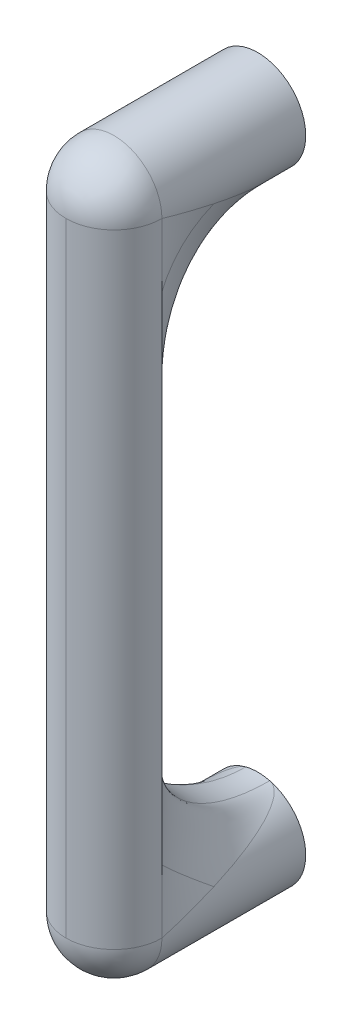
ISO-10303-21;
HEADER;
FILE_DESCRIPTION(('STEP AP214'),'2;1');
FILE_NAME('part.step','',(''),(''),'','','');
FILE_SCHEMA(('AUTOMOTIVE_DESIGN { 1 0 10303 214 1 1 1 1 }'));
ENDSEC;
DATA;
#1=APPLICATION_CONTEXT('core data for automotive mechanical design processes');
#2=APPLICATION_PROTOCOL_DEFINITION('international standard','automotive_design',2000,#1);
#3=PRODUCT_CONTEXT('',#1,'mechanical');
#4=PRODUCT('Part','Part','',(#3));
#5=PRODUCT_RELATED_PRODUCT_CATEGORY('part','',(#4));
#6=PRODUCT_DEFINITION_FORMATION('','',#4);
#7=PRODUCT_DEFINITION_CONTEXT('part definition',#1,'design');
#8=PRODUCT_DEFINITION('design','',#6,#7);
#9=PRODUCT_DEFINITION_SHAPE('','',#8);
#10=(LENGTH_UNIT() NAMED_UNIT(*) SI_UNIT(.MILLI.,.METRE.));
#11=(NAMED_UNIT(*) PLANE_ANGLE_UNIT() SI_UNIT($,.RADIAN.));
#12=(NAMED_UNIT(*) SI_UNIT($,.STERADIAN.) SOLID_ANGLE_UNIT());
#13=UNCERTAINTY_MEASURE_WITH_UNIT(LENGTH_MEASURE(1.E-05),#10,'distance_accuracy_value','');
#14=(GEOMETRIC_REPRESENTATION_CONTEXT(3) GLOBAL_UNCERTAINTY_ASSIGNED_CONTEXT((#13)) GLOBAL_UNIT_ASSIGNED_CONTEXT((#10,
#11,#12)) REPRESENTATION_CONTEXT('',''));
#15=CARTESIAN_POINT('',(0.,0.,0.));
#16=DIRECTION('',(0.,0.,1.));
#17=DIRECTION('',(1.,0.,0.));
#18=AXIS2_PLACEMENT_3D('',#15,#16,#17);
#19=CARTESIAN_POINT('',(10.,29.5569194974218,30.));
#20=CARTESIAN_POINT('',(-1.28896627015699,53.0399956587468,26.6470617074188));
#21=CARTESIAN_POINT('',(4.63538054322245,56.1392298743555,1.2416551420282));
#22=CARTESIAN_POINT('',(10.,30.006472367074,30.));
#23=CARTESIAN_POINT('',(-1.41853773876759,52.7900669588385,26.2436274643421));
#24=CARTESIAN_POINT('',(4.85026175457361,56.251618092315,1.4969540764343));
#25=CARTESIAN_POINT('',(10.,30.4828283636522,30.));
#26=CARTESIAN_POINT('',(-1.4610675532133,52.5590401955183,25.8487109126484));
#27=CARTESIAN_POINT('',(5.0588375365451,56.3707070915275,1.78665612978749));
#28=CARTESIAN_POINT('',(10.,31.4811991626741,30.));
#29=CARTESIAN_POINT('',(-1.40019853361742,52.1580790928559,25.1081841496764));
#30=CARTESIAN_POINT('',(5.46229140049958,56.6202997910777,2.42558383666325));
#31=CARTESIAN_POINT('',(10.,32.0030963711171,30.));
#32=CARTESIAN_POINT('',(-1.29977683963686,51.9871409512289,24.7620009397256));
#33=CARTESIAN_POINT('',(5.65720254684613,56.7507740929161,2.77465827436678));
#34=CARTESIAN_POINT('',(10.,33.1570176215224,30.));
#35=CARTESIAN_POINT('',(-0.967511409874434,51.7032362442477,24.0986782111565));
#36=CARTESIAN_POINT('',(6.05764855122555,57.0392544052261,3.57290191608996));
#37=CARTESIAN_POINT('',(10.,33.7945547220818,30.));
#38=CARTESIAN_POINT('',(-0.722705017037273,51.5984968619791,23.7886979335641));
#39=CARTESIAN_POINT('',(6.26129682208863,57.1986386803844,4.02917777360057));
#40=CARTESIAN_POINT('',(10.,35.1125722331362,30.));
#41=CARTESIAN_POINT('',(-0.139167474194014,51.4893009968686,23.2671457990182));
#42=CARTESIAN_POINT('',(6.65105400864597,57.5281430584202,4.9971499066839));
#43=CARTESIAN_POINT('',(10.,35.7930781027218,30.));
#44=CARTESIAN_POINT('',(0.197819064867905,51.4829070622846,23.0536304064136));
#45=CARTESIAN_POINT('',(6.83715236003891,57.6982695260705,5.50887916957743));
#46=CARTESIAN_POINT('',(10.,37.1923380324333,30.));
#47=CARTESIAN_POINT('',(0.926365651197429,51.5667050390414,22.7246456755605));
#48=CARTESIAN_POINT('',(7.19258668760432,58.0480845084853,6.58056850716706));
#49=CARTESIAN_POINT('',(10.,37.9112349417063,30.));
#50=CARTESIAN_POINT('',(1.31740348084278,51.6554850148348,22.60757556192));
#51=CARTESIAN_POINT('',(7.3618522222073,58.2278087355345,7.14071431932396));
#52=CARTESIAN_POINT('',(10.,39.3785212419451,30.));
#53=CARTESIAN_POINT('',(2.12083179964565,51.9211843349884,22.4662391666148));
#54=CARTESIAN_POINT('',(7.68314320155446,58.5946303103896,8.29956091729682));
#55=CARTESIAN_POINT('',(10.,40.1269090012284,30.));
#56=CARTESIAN_POINT('',(2.53325177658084,52.0966853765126,22.4402669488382));
#57=CARTESIAN_POINT('',(7.83516959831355,58.7817272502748,8.89825957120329));
#58=CARTESIAN_POINT('',(10.,41.9425604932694,30.));
#59=CARTESIAN_POINT('',(3.51145245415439,52.6063816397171,22.4773956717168));
#60=CARTESIAN_POINT('',(8.17810691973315,59.2356401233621,10.3656382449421));
#61=CARTESIAN_POINT('',(10.,43.0211883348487,30.));
#62=CARTESIAN_POINT('',(4.08036964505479,52.9757215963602,22.5760262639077));
#63=CARTESIAN_POINT('',(8.36131074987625,59.50529708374,11.2491675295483));
#64=CARTESIAN_POINT('',(10.,45.2146676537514,30.));
#65=CARTESIAN_POINT('',(5.16897091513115,53.8341120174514,22.9048914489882));
#66=CARTESIAN_POINT('',(8.69696487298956,60.0536669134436,13.0637504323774));
#67=CARTESIAN_POINT('',(10.,46.3295348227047,30.));
#68=CARTESIAN_POINT('',(5.69106948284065,54.322125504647,23.1331382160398));
#69=CARTESIAN_POINT('',(8.84940163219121,60.3323837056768,13.9948247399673));
#70=CARTESIAN_POINT('',(10.,48.5862433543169,30.));
#71=CARTESIAN_POINT('',(6.65947187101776,55.3900319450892,23.692490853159));
#72=CARTESIAN_POINT('',(9.12470714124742,60.8965608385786,15.8927189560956));
#73=CARTESIAN_POINT('',(10.,49.728079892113,30.));
#74=CARTESIAN_POINT('',(7.1083949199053,55.9700213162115,24.0227763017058));
#75=CARTESIAN_POINT('',(9.24758113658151,61.1820199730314,16.8595324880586));
#76=CARTESIAN_POINT('',(10.,52.0315464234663,30.));
#77=CARTESIAN_POINT('',(7.91493778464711,57.197868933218,24.7604491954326));
#78=CARTESIAN_POINT('',(9.46485004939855,61.7578866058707,18.8195362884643));
#79=CARTESIAN_POINT('',(10.,53.193171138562,30.));
#80=CARTESIAN_POINT('',(8.274936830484,57.8467086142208,25.1679625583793));
#81=CARTESIAN_POINT('',(9.55925243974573,62.0482927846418,19.8127195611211));
#82=CARTESIAN_POINT('',(10.,55.2362713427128,30.));
#83=CARTESIAN_POINT('',(8.8176807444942,59.023767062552,25.9288671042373));
#84=CARTESIAN_POINT('',(9.70016799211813,62.5590678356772,21.5654296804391));
#85=CARTESIAN_POINT('',(10.,56.114663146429,30.));
#86=CARTESIAN_POINT('',(9.02268437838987,59.5409837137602,26.2697862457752));
#87=CARTESIAN_POINT('',(9.75275421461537,62.7786657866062,22.3208424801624));
#88=CARTESIAN_POINT('',(10.,57.8772446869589,30.));
#89=CARTESIAN_POINT('',(9.37516205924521,60.5945438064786,26.9737161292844));
#90=CARTESIAN_POINT('',(9.84275066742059,63.2193111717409,23.8393672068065));
#91=CARTESIAN_POINT('',(10.,58.7614354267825,30.));
#92=CARTESIAN_POINT('',(9.52323064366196,61.1316993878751,27.337222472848));
#93=CARTESIAN_POINT('',(9.88015819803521,63.4403588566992,24.602480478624));
#94=CARTESIAN_POINT('',(10.,61.4165911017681,30.));
#95=CARTESIAN_POINT('',(9.87760160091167,62.7566556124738,28.4458443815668));
#96=CARTESIAN_POINT('',(9.96978108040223,64.1041477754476,26.8966840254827));
#97=CARTESIAN_POINT('',(10.,63.1940252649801,30.));
#98=CARTESIAN_POINT('',(9.99863919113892,63.8712449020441,29.2179759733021));
#99=CARTESIAN_POINT('',(9.99966165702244,64.5485063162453,28.4359800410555));
#100=CARTESIAN_POINT('',(10.,64.9798419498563,30.));
#101=CARTESIAN_POINT('',(9.99999623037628,64.9874012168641,29.9912713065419));
#102=CARTESIAN_POINT('',(9.99999904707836,64.9949604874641,29.9825426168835));
#103=CARTESIAN_POINT('',(10.,64.9899210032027,30.));
#104=CARTESIAN_POINT('',(10.0000000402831,64.9937006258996,29.9956356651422));
#105=CARTESIAN_POINT('',(9.99999999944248,64.9974802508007,29.9912713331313));
#106=CARTESIAN_POINT('',(10.,65.,30.));
#107=CARTESIAN_POINT('',(10.,65.,30.));
#108=CARTESIAN_POINT('',(10.,65.,30.));
#109=(BOUNDED_SURFACE() B_SPLINE_SURFACE(3,2,((#19,#20,#21),(#22,#23,#24),(#25,#26,#27),(#28,
#29,#30),(#31,#32,#33),(#34,#35,#36),(#37,#38,#39),(#40,#41,#42),(#43,#44,#45),(#46,#47,#48),
(#49,#50,#51),(#52,#53,#54),(#55,#56,#57),(#58,#59,#60),(#61,#62,#63),(#64,#65,#66),(#67,#68,
#69),(#70,#71,#72),(#73,#74,#75),(#76,#77,#78),(#79,#80,#81),(#82,#83,#84),(#85,#86,#87),(#88,
#89,#90),(#91,#92,#93),(#94,#95,#96),(#97,#98,#99),(#100,#101,#102),(#103,#104,#105),(#106,#107,
#108)),.UNSPECIFIED.,.F.,.F.,.F.) B_SPLINE_SURFACE_WITH_KNOTS((4,2,2,2,2,2,2,2,2,2,2,2,2,2,4),
(3,3),(0.,3.00656384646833,6.00558188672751,9.39249454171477,12.7814331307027,16.1840044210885,
19.5863877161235,24.3049129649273,29.0255092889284,33.745267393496,38.463785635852,
41.994575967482,45.5259940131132,52.5731956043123,52.613195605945),(0.,1.),
.UNSPECIFIED.) GEOMETRIC_REPRESENTATION_ITEM() RATIONAL_B_SPLINE_SURFACE(((1.,0.752322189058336,
1.),(1.,0.758773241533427,1.),(1.,0.765556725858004,1.),(1.,0.779518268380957,1.),(1.,
0.786695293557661,1.),(1.,0.80214712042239,1.),(1.,0.810443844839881,1.),(1.,0.826966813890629,
1.),(1.,0.835193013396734,1.),(1.,0.851391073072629,1.),(1.,0.859361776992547,1.),(1.,
0.874856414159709,1.),(1.,0.882380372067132,1.),(1.,0.899672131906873,1.),(1.,0.909182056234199,
1.),(1.,0.926925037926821,1.),(1.,0.935157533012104,1.),(1.,0.950221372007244,1.),(1.,
0.957052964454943,1.),(1.,0.969243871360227,1.),(1.,0.974603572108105,1.),(1.,0.982652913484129,
1.),(1.,0.985675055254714,1.),(1.,0.990864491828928,1.),(1.,0.9930316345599,1.),(1.,
0.998232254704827,1.),(1.,0.999980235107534,1.),(1.,0.999999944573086,1.),(1.,1.00000000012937,
1.),(1.,1.,1.))) REPRESENTATION_ITEM('') SURFACE());
#110=CARTESIAN_POINT('',(9.43679007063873,61.6913759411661,18.5940762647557));
#111=CARTESIAN_POINT('',(7.81490976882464,57.0654820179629,24.6843368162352));
#112=CARTESIAN_POINT('',(10.,51.7655037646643,30.));
#113=(BOUNDED_CURVE() B_SPLINE_CURVE(2,(#110,#111,#112),.UNSPECIFIED.,.F.,
.F.) B_SPLINE_CURVE_WITH_KNOTS((3,3),(0.,1.),
.UNSPECIFIED.) CURVE() GEOMETRIC_REPRESENTATION_ITEM() RATIONAL_B_SPLINE_CURVE((1.,
0.96768118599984,1.)) REPRESENTATION_ITEM(''));
#114=CARTESIAN_POINT('',(9.43679007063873,61.6913759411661,18.5940762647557));
#115=VERTEX_POINT('',#114);
#116=CARTESIAN_POINT('',(10.,51.7655037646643,30.));
#117=VERTEX_POINT('',#116);
#118=EDGE_CURVE('E11',#115,#117,#113,.T.);
#119=ORIENTED_EDGE('',*,*,#118,.F.);
#120=CARTESIAN_POINT('',(4.63538054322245,56.1392298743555,1.2416551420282));
#121=CARTESIAN_POINT('',(4.85026175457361,56.251618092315,1.4969540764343));
#122=CARTESIAN_POINT('',(5.0588375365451,56.3707070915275,1.78665612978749));
#123=CARTESIAN_POINT('',(5.46229140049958,56.6202997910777,2.42558383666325));
#124=CARTESIAN_POINT('',(5.65720254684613,56.7507740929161,2.77465827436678));
#125=CARTESIAN_POINT('',(6.05764855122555,57.0392544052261,3.57290191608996));
#126=CARTESIAN_POINT('',(6.26129682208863,57.1986386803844,4.02917777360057));
#127=CARTESIAN_POINT('',(6.65105400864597,57.5281430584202,4.9971499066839));
#128=CARTESIAN_POINT('',(6.83715236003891,57.6982695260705,5.50887916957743));
#129=CARTESIAN_POINT('',(7.19258668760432,58.0480845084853,6.58056850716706));
#130=CARTESIAN_POINT('',(7.3618522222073,58.2278087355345,7.14071431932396));
#131=CARTESIAN_POINT('',(7.68314320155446,58.5946303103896,8.29956091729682));
#132=CARTESIAN_POINT('',(7.83516959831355,58.7817272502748,8.89825957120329));
#133=CARTESIAN_POINT('',(8.17810691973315,59.2356401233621,10.3656382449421));
#134=CARTESIAN_POINT('',(8.36131074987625,59.50529708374,11.2491675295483));
#135=CARTESIAN_POINT('',(8.69696487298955,60.0536669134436,13.0637504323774));
#136=CARTESIAN_POINT('',(8.84940163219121,60.3323837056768,13.9948247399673));
#137=CARTESIAN_POINT('',(9.12470714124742,60.8965608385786,15.8927189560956));
#138=CARTESIAN_POINT('',(9.24758113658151,61.1820199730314,16.8595324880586));
#139=CARTESIAN_POINT('',(9.46485004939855,61.7578866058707,18.8195362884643));
#140=CARTESIAN_POINT('',(9.55925243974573,62.0482927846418,19.8127195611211));
#141=CARTESIAN_POINT('',(9.70016799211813,62.5590678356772,21.5654296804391));
#142=CARTESIAN_POINT('',(9.75275421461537,62.7786657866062,22.3208424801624));
#143=CARTESIAN_POINT('',(9.84275066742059,63.2193111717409,23.8393672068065));
#144=CARTESIAN_POINT('',(9.88015819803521,63.4403588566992,24.602480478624));
#145=CARTESIAN_POINT('',(9.96978108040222,64.1041477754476,26.8966840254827));
#146=CARTESIAN_POINT('',(9.99966165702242,64.5485063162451,28.4359800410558));
#147=CARTESIAN_POINT('',(9.99999904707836,64.9949604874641,29.9825426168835));
#148=CARTESIAN_POINT('',(9.99999999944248,64.9974802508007,29.9912713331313));
#149=CARTESIAN_POINT('',(10.,65.,30.));
#150=B_SPLINE_CURVE_WITH_KNOTS('',3,(#120,#121,#122,#123,#124,#125,#126,#127,#128,#129,#130,
#131,#132,#133,#134,#135,#136,#137,#138,#139,#140,#141,#142,#143,#144,#145,#146,#147,#148,#149),
.UNSPECIFIED.,.F.,.F.,(4,2,2,2,2,2,2,2,2,2,2,2,2,2,4),(0.,3.00656384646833,6.00558188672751,
9.39249454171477,12.7814331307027,16.1840044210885,19.5863877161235,24.3049129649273,
29.0255092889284,33.745267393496,38.463785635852,41.994575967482,45.5259940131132,
52.5731956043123,52.613195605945),.UNSPECIFIED.);
#151=CARTESIAN_POINT('',(10.,65.,30.));
#152=VERTEX_POINT('',#151);
#153=EDGE_CURVE('E306',#152,#115,#150,.F.);
#154=ORIENTED_EDGE('',*,*,#153,.F.);
#155=DIRECTION('',(0.,1.,0.));
#156=VECTOR('',#155,1.);
#157=CARTESIAN_POINT('',(10.,-65.,30.));
#158=LINE('',#157,#156);
#159=EDGE_CURVE('E422',#117,#152,#158,.T.);
#160=ORIENTED_EDGE('',*,*,#159,.F.);
#161=EDGE_LOOP('',(#119,#154,#160));
#162=FACE_BOUND('',#161,.T.);
#163=ADVANCED_FACE('F41',(#162),#109,.F.);
#164=CARTESIAN_POINT('',(-4.63538054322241,56.1392298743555,1.2416551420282));
#165=CARTESIAN_POINT('',(1.28896627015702,53.0399956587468,26.6470617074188));
#166=CARTESIAN_POINT('',(-9.99999999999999,29.5569194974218,30.));
#167=CARTESIAN_POINT('',(-4.85026175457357,56.251618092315,1.4969540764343));
#168=CARTESIAN_POINT('',(1.41853773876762,52.7900669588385,26.2436274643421));
#169=CARTESIAN_POINT('',(-9.99999999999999,30.006472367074,30.));
#170=CARTESIAN_POINT('',(-5.05883753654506,56.3707070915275,1.78665612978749));
#171=CARTESIAN_POINT('',(1.46106755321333,52.5590401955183,25.8487109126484));
#172=CARTESIAN_POINT('',(-9.99999999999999,30.4828283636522,30.));
#173=CARTESIAN_POINT('',(-5.46229140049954,56.6202997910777,2.42558383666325));
#174=CARTESIAN_POINT('',(1.40019853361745,52.1580790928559,25.1081841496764));
#175=CARTESIAN_POINT('',(-9.99999999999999,31.4811991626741,30.));
#176=CARTESIAN_POINT('',(-5.65720254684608,56.7507740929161,2.77465827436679));
#177=CARTESIAN_POINT('',(1.2997768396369,51.9871409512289,24.7620009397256));
#178=CARTESIAN_POINT('',(-9.99999999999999,32.0030963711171,30.));
#179=CARTESIAN_POINT('',(-6.05764855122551,57.0392544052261,3.57290191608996));
#180=CARTESIAN_POINT('',(0.96751140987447,51.7032362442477,24.0986782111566));
#181=CARTESIAN_POINT('',(-9.99999999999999,33.1570176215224,30.));
#182=CARTESIAN_POINT('',(-6.26129682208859,57.1986386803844,4.02917777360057));
#183=CARTESIAN_POINT('',(0.722705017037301,51.5984968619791,23.7886979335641));
#184=CARTESIAN_POINT('',(-9.99999999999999,33.7945547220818,30.));
#185=CARTESIAN_POINT('',(-6.65105400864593,57.5281430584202,4.9971499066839));
#186=CARTESIAN_POINT('',(0.139167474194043,51.4893009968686,23.2671457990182));
#187=CARTESIAN_POINT('',(-9.99999999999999,35.1125722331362,30.));
#188=CARTESIAN_POINT('',(-6.83715236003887,57.6982695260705,5.50887916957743));
#189=CARTESIAN_POINT('',(-0.197819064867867,51.4829070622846,23.0536304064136));
#190=CARTESIAN_POINT('',(-9.99999999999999,35.7930781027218,30.));
#191=CARTESIAN_POINT('',(-7.19258668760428,58.0480845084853,6.58056850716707));
#192=CARTESIAN_POINT('',(-0.92636565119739,51.5667050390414,22.7246456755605));
#193=CARTESIAN_POINT('',(-9.99999999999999,37.1923380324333,30.));
#194=CARTESIAN_POINT('',(-7.36185222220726,58.2278087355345,7.14071431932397));
#195=CARTESIAN_POINT('',(-1.31740348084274,51.6554850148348,22.60757556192));
#196=CARTESIAN_POINT('',(-9.99999999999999,37.9112349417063,30.));
#197=CARTESIAN_POINT('',(-7.68314320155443,58.5946303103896,8.29956091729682));
#198=CARTESIAN_POINT('',(-2.12083179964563,51.9211843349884,22.4662391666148));
#199=CARTESIAN_POINT('',(-9.99999999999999,39.3785212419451,30.));
#200=CARTESIAN_POINT('',(-7.83516959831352,58.7817272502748,8.89825957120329));
#201=CARTESIAN_POINT('',(-2.53325177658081,52.0966853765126,22.4402669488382));
#202=CARTESIAN_POINT('',(-9.99999999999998,40.1269090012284,30.));
#203=CARTESIAN_POINT('',(-8.17810691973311,59.2356401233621,10.3656382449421));
#204=CARTESIAN_POINT('',(-3.51145245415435,52.6063816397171,22.4773956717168));
#205=CARTESIAN_POINT('',(-9.99999999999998,41.9425604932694,30.));
#206=CARTESIAN_POINT('',(-8.36131074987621,59.50529708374,11.2491675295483));
#207=CARTESIAN_POINT('',(-4.08036964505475,52.9757215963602,22.5760262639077));
#208=CARTESIAN_POINT('',(-9.99999999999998,43.0211883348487,30.));
#209=CARTESIAN_POINT('',(-8.69696487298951,60.0536669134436,13.0637504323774));
#210=CARTESIAN_POINT('',(-5.1689709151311,53.8341120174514,22.9048914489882));
#211=CARTESIAN_POINT('',(-9.99999999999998,45.2146676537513,30.));
#212=CARTESIAN_POINT('',(-8.84940163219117,60.3323837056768,13.9948247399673));
#213=CARTESIAN_POINT('',(-5.69106948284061,54.3221255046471,23.1331382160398));
#214=CARTESIAN_POINT('',(-9.99999999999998,46.3295348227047,30.));
#215=CARTESIAN_POINT('',(-9.12470714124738,60.8965608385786,15.8927189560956));
#216=CARTESIAN_POINT('',(-6.65947187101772,55.3900319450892,23.692490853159));
#217=CARTESIAN_POINT('',(-9.99999999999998,48.5862433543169,30.));
#218=CARTESIAN_POINT('',(-9.24758113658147,61.1820199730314,16.8595324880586));
#219=CARTESIAN_POINT('',(-7.10839491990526,55.9700213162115,24.0227763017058));
#220=CARTESIAN_POINT('',(-9.99999999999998,49.728079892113,30.));
#221=CARTESIAN_POINT('',(-9.4648500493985,61.7578866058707,18.8195362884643));
#222=CARTESIAN_POINT('',(-7.91493778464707,57.197868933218,24.7604491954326));
#223=CARTESIAN_POINT('',(-9.99999999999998,52.0315464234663,30.));
#224=CARTESIAN_POINT('',(-9.55925243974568,62.0482927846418,19.8127195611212));
#225=CARTESIAN_POINT('',(-8.27493683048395,57.8467086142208,25.1679625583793));
#226=CARTESIAN_POINT('',(-9.99999999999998,53.193171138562,30.));
#227=CARTESIAN_POINT('',(-9.70016799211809,62.5590678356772,21.5654296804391));
#228=CARTESIAN_POINT('',(-8.81768074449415,59.023767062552,25.9288671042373));
#229=CARTESIAN_POINT('',(-9.99999999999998,55.2362713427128,30.));
#230=CARTESIAN_POINT('',(-9.75275421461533,62.7786657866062,22.3208424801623));
#231=CARTESIAN_POINT('',(-9.02268437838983,59.5409837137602,26.2697862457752));
#232=CARTESIAN_POINT('',(-9.99999999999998,56.1146631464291,30.));
#233=CARTESIAN_POINT('',(-9.84275066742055,63.2193111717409,23.8393672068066));
#234=CARTESIAN_POINT('',(-9.37516205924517,60.5945438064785,26.9737161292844));
#235=CARTESIAN_POINT('',(-9.99999999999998,57.8772446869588,30.));
#236=CARTESIAN_POINT('',(-9.88015819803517,63.4403588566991,24.6024804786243));
#237=CARTESIAN_POINT('',(-9.52323064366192,61.131699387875,27.3372224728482));
#238=CARTESIAN_POINT('',(-9.99999999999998,58.7614354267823,30.));
#239=CARTESIAN_POINT('',(-9.96978108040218,64.1041477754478,26.8966840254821));
#240=CARTESIAN_POINT('',(-9.87760160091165,62.7566556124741,28.4458443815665));
#241=CARTESIAN_POINT('',(-9.99999999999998,61.4165911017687,30.));
#242=CARTESIAN_POINT('',(-9.9996616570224,64.548506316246,28.4359800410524));
#243=CARTESIAN_POINT('',(-9.99863919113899,63.8712449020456,29.2179759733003));
#244=CARTESIAN_POINT('',(-9.99999999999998,63.1940252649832,30.));
#245=CARTESIAN_POINT('',(-9.99999904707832,64.9949604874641,29.9825426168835));
#246=CARTESIAN_POINT('',(-9.99999623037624,64.9874012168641,29.9912713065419));
#247=CARTESIAN_POINT('',(-9.99999999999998,64.9798419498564,30.));
#248=CARTESIAN_POINT('',(-9.99999999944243,64.9974802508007,29.9912713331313));
#249=CARTESIAN_POINT('',(-10.0000000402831,64.9937006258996,29.9956356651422));
#250=CARTESIAN_POINT('',(-9.99999999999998,64.9899210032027,30.));
#251=CARTESIAN_POINT('',(-9.99999999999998,65.,30.));
#252=CARTESIAN_POINT('',(-9.99999999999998,65.,30.));
#253=CARTESIAN_POINT('',(-9.99999999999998,65.,30.));
#254=(BOUNDED_SURFACE() B_SPLINE_SURFACE(3,2,((#164,#165,#166),(#167,#168,#169),(#170,#171,
#172),(#173,#174,#175),(#176,#177,#178),(#179,#180,#181),(#182,#183,#184),(#185,#186,#187),
(#188,#189,#190),(#191,#192,#193),(#194,#195,#196),(#197,#198,#199),(#200,#201,#202),(#203,#204,
#205),(#206,#207,#208),(#209,#210,#211),(#212,#213,#214),(#215,#216,#217),(#218,#219,#220),
(#221,#222,#223),(#224,#225,#226),(#227,#228,#229),(#230,#231,#232),(#233,#234,#235),(#236,#237,
#238),(#239,#240,#241),(#242,#243,#244),(#245,#246,#247),(#248,#249,#250),(#251,#252,#253)),
.UNSPECIFIED.,.F.,.F.,.F.) B_SPLINE_SURFACE_WITH_KNOTS((4,2,2,2,2,2,2,2,2,2,2,2,2,2,4),(3,3),
(0.,3.00656384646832,6.0055818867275,9.39249454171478,12.7814331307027,16.1840044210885,
19.5863877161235,24.3049129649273,29.0255092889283,33.745267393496,38.463785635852,
41.994575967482,45.5259940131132,52.5731956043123,52.6131956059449),(0.,1.),
.UNSPECIFIED.) GEOMETRIC_REPRESENTATION_ITEM() RATIONAL_B_SPLINE_SURFACE(((1.,0.752322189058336,
1.),(1.,0.758773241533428,1.),(1.,0.765556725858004,1.),(1.,0.779518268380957,1.),(1.,
0.786695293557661,1.),(1.,0.80214712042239,1.),(1.,0.810443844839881,1.),(1.,0.826966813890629,
1.),(1.,0.835193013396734,1.),(1.,0.851391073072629,1.),(1.,0.859361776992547,1.),(1.,
0.874856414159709,1.),(1.,0.882380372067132,1.),(1.,0.899672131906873,1.),(1.,0.909182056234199,
1.),(1.,0.926925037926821,1.),(1.,0.935157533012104,1.),(1.,0.950221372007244,1.),(1.,
0.957052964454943,1.),(1.,0.969243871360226,1.),(1.,0.974603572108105,1.),(1.,0.982652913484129,
1.),(1.,0.985675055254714,1.),(1.,0.990864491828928,1.),(1.,0.9930316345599,1.),(1.,
0.998232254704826,1.),(1.,0.999980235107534,1.),(1.,0.999999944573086,1.),(1.,1.00000000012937,
1.),(1.,1.,1.))) REPRESENTATION_ITEM('') SURFACE());
#255=CARTESIAN_POINT('',(-9.99999999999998,51.7655037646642,30.));
#256=CARTESIAN_POINT('',(-7.81490976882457,57.0654820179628,24.6843368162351));
#257=CARTESIAN_POINT('',(-9.43679007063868,61.6913759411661,18.5940762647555));
#258=(BOUNDED_CURVE() B_SPLINE_CURVE(2,(#255,#256,#257),.UNSPECIFIED.,.F.,
.F.) B_SPLINE_CURVE_WITH_KNOTS((3,3),(0.,1.),
.UNSPECIFIED.) CURVE() GEOMETRIC_REPRESENTATION_ITEM() RATIONAL_B_SPLINE_CURVE((1.,
0.96768118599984,1.)) REPRESENTATION_ITEM(''));
#259=CARTESIAN_POINT('',(-9.99999999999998,51.7655037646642,30.));
#260=VERTEX_POINT('',#259);
#261=CARTESIAN_POINT('',(-9.43679007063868,61.6913759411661,18.5940762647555));
#262=VERTEX_POINT('',#261);
#263=EDGE_CURVE('E56',#260,#262,#258,.T.);
#264=ORIENTED_EDGE('',*,*,#263,.F.);
#265=DIRECTION('',(0.,-1.,0.));
#266=VECTOR('',#265,1.);
#267=CARTESIAN_POINT('',(-9.99999999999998,65.,30.));
#268=LINE('',#267,#266);
#269=CARTESIAN_POINT('',(-9.99999999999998,65.,30.));
#270=VERTEX_POINT('',#269);
#271=EDGE_CURVE('E415',#270,#260,#268,.T.);
#272=ORIENTED_EDGE('',*,*,#271,.F.);
#273=CARTESIAN_POINT('',(-4.63538054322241,56.1392298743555,1.2416551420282));
#274=CARTESIAN_POINT('',(-4.85026175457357,56.251618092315,1.4969540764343));
#275=CARTESIAN_POINT('',(-5.05883753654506,56.3707070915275,1.78665612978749));
#276=CARTESIAN_POINT('',(-5.46229140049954,56.6202997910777,2.42558383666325));
#277=CARTESIAN_POINT('',(-5.65720254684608,56.7507740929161,2.77465827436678));
#278=CARTESIAN_POINT('',(-6.05764855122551,57.0392544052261,3.57290191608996));
#279=CARTESIAN_POINT('',(-6.26129682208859,57.1986386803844,4.02917777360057));
#280=CARTESIAN_POINT('',(-6.65105400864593,57.5281430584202,4.9971499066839));
#281=CARTESIAN_POINT('',(-6.83715236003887,57.6982695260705,5.50887916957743));
#282=CARTESIAN_POINT('',(-7.19258668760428,58.0480845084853,6.58056850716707));
#283=CARTESIAN_POINT('',(-7.36185222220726,58.2278087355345,7.14071431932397));
#284=CARTESIAN_POINT('',(-7.68314320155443,58.5946303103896,8.29956091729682));
#285=CARTESIAN_POINT('',(-7.83516959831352,58.7817272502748,8.89825957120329));
#286=CARTESIAN_POINT('',(-8.17810691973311,59.2356401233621,10.3656382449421));
#287=CARTESIAN_POINT('',(-8.36131074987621,59.50529708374,11.2491675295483));
#288=CARTESIAN_POINT('',(-8.69696487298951,60.0536669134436,13.0637504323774));
#289=CARTESIAN_POINT('',(-8.84940163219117,60.3323837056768,13.9948247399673));
#290=CARTESIAN_POINT('',(-9.12470714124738,60.8965608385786,15.8927189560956));
#291=CARTESIAN_POINT('',(-9.24758113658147,61.1820199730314,16.8595324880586));
#292=CARTESIAN_POINT('',(-9.46485004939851,61.7578866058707,18.8195362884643));
#293=CARTESIAN_POINT('',(-9.55925243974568,62.0482927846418,19.8127195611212));
#294=CARTESIAN_POINT('',(-9.70016799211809,62.5590678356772,21.5654296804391));
#295=CARTESIAN_POINT('',(-9.75275421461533,62.7786657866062,22.3208424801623));
#296=CARTESIAN_POINT('',(-9.84275066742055,63.2193111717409,23.8393672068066));
#297=CARTESIAN_POINT('',(-9.88015819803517,63.4403588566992,24.6024804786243));
#298=CARTESIAN_POINT('',(-9.96978108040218,64.1041477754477,26.8966840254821));
#299=CARTESIAN_POINT('',(-9.99966165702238,64.5485063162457,28.4359800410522));
#300=CARTESIAN_POINT('',(-9.99999904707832,64.9949604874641,29.9825426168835));
#301=CARTESIAN_POINT('',(-9.99999999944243,64.9974802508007,29.9912713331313));
#302=CARTESIAN_POINT('',(-9.99999999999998,65.,30.));
#303=B_SPLINE_CURVE_WITH_KNOTS('',3,(#273,#274,#275,#276,#277,#278,#279,#280,#281,#282,#283,
#284,#285,#286,#287,#288,#289,#290,#291,#292,#293,#294,#295,#296,#297,#298,#299,#300,#301,#302),
.UNSPECIFIED.,.F.,.F.,(4,2,2,2,2,2,2,2,2,2,2,2,2,2,4),(0.,3.00656384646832,6.0055818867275,
9.39249454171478,12.7814331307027,16.1840044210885,19.5863877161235,24.3049129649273,
29.0255092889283,33.745267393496,38.463785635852,41.994575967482,45.5259940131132,
52.5731956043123,52.6131956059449),.UNSPECIFIED.);
#304=EDGE_CURVE('E166',#262,#270,#303,.T.);
#305=ORIENTED_EDGE('',*,*,#304,.F.);
#306=EDGE_LOOP('',(#264,#272,#305));
#307=FACE_BOUND('',#306,.T.);
#308=ADVANCED_FACE('F436',(#307),#254,.F.);
#309=CARTESIAN_POINT('',(-10.,-29.5569194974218,30.));
#310=CARTESIAN_POINT('',(1.28896627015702,-53.0399956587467,26.6470617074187));
#311=CARTESIAN_POINT('',(-4.63538054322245,-56.1392298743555,1.24165514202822));
#312=CARTESIAN_POINT('',(-10.,-30.006472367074,30.));
#313=CARTESIAN_POINT('',(1.41853773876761,-52.7900669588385,26.2436274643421));
#314=CARTESIAN_POINT('',(-4.85026175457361,-56.251618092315,1.49695407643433));
#315=CARTESIAN_POINT('',(-10.,-30.4828283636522,30.));
#316=CARTESIAN_POINT('',(1.46106755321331,-52.5590401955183,25.8487109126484));
#317=CARTESIAN_POINT('',(-5.05883753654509,-56.3707070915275,1.78665612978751));
#318=CARTESIAN_POINT('',(-10.,-31.4811991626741,30.));
#319=CARTESIAN_POINT('',(1.40019853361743,-52.1580790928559,25.1081841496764));
#320=CARTESIAN_POINT('',(-5.46229140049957,-56.6202997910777,2.42558383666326));
#321=CARTESIAN_POINT('',(-10.,-32.0030963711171,30.));
#322=CARTESIAN_POINT('',(1.29977683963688,-51.9871409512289,24.7620009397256));
#323=CARTESIAN_POINT('',(-5.65720254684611,-56.7507740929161,2.77465827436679));
#324=CARTESIAN_POINT('',(-10.,-33.1570176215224,30.));
#325=CARTESIAN_POINT('',(0.967511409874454,-51.7032362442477,24.0986782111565));
#326=CARTESIAN_POINT('',(-6.05764855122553,-57.0392544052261,3.57290191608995));
#327=CARTESIAN_POINT('',(-10.,-33.7945547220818,30.));
#328=CARTESIAN_POINT('',(0.722705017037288,-51.5984968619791,23.7886979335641));
#329=CARTESIAN_POINT('',(-6.26129682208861,-57.1986386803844,4.02917777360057));
#330=CARTESIAN_POINT('',(-10.,-35.1125722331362,30.));
#331=CARTESIAN_POINT('',(0.139167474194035,-51.4893009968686,23.2671457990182));
#332=CARTESIAN_POINT('',(-6.65105400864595,-57.5281430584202,4.9971499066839));
#333=CARTESIAN_POINT('',(-10.,-35.7930781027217,30.));
#334=CARTESIAN_POINT('',(-0.197819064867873,-51.4829070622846,23.0536304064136));
#335=CARTESIAN_POINT('',(-6.83715236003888,-57.6982695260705,5.50887916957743));
#336=CARTESIAN_POINT('',(-10.,-37.1923380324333,30.));
#337=CARTESIAN_POINT('',(-0.926365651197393,-51.5667050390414,22.7246456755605));
#338=CARTESIAN_POINT('',(-7.19258668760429,-58.0480845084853,6.58056850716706));
#339=CARTESIAN_POINT('',(-10.,-37.9112349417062,30.));
#340=CARTESIAN_POINT('',(-1.31740348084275,-51.6554850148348,22.60757556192));
#341=CARTESIAN_POINT('',(-7.36185222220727,-58.2278087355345,7.14071431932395));
#342=CARTESIAN_POINT('',(-10.,-39.3785212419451,30.));
#343=CARTESIAN_POINT('',(-2.12083179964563,-51.9211843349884,22.4662391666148));
#344=CARTESIAN_POINT('',(-7.68314320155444,-58.5946303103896,8.29956091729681));
#345=CARTESIAN_POINT('',(-10.,-40.1269090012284,30.));
#346=CARTESIAN_POINT('',(-2.53325177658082,-52.0966853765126,22.4402669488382));
#347=CARTESIAN_POINT('',(-7.83516959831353,-58.7817272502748,8.89825957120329));
#348=CARTESIAN_POINT('',(-10.,-41.9425604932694,30.));
#349=CARTESIAN_POINT('',(-3.51145245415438,-52.6063816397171,22.4773956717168));
#350=CARTESIAN_POINT('',(-8.17810691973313,-59.2356401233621,10.3656382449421));
#351=CARTESIAN_POINT('',(-10.,-43.0211883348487,30.));
#352=CARTESIAN_POINT('',(-4.08036964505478,-52.9757215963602,22.5760262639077));
#353=CARTESIAN_POINT('',(-8.36131074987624,-59.50529708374,11.2491675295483));
#354=CARTESIAN_POINT('',(-10.,-45.2146676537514,30.));
#355=CARTESIAN_POINT('',(-5.16897091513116,-53.8341120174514,22.9048914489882));
#356=CARTESIAN_POINT('',(-8.69696487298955,-60.0536669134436,13.0637504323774));
#357=CARTESIAN_POINT('',(-10.,-46.3295348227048,30.));
#358=CARTESIAN_POINT('',(-5.69106948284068,-54.3221255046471,23.1331382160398));
#359=CARTESIAN_POINT('',(-8.8494016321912,-60.3323837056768,13.9948247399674));
#360=CARTESIAN_POINT('',(-10.,-48.586243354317,30.));
#361=CARTESIAN_POINT('',(-6.65947187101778,-55.3900319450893,23.6924908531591));
#362=CARTESIAN_POINT('',(-9.12470714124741,-60.8965608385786,15.8927189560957));
#363=CARTESIAN_POINT('',(-10.,-49.728079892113,30.));
#364=CARTESIAN_POINT('',(-7.10839491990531,-55.9700213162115,24.0227763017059));
#365=CARTESIAN_POINT('',(-9.2475811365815,-61.1820199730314,16.8595324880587));
#366=CARTESIAN_POINT('',(-10.,-52.0315464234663,30.));
#367=CARTESIAN_POINT('',(-7.91493778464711,-57.197868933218,24.7604491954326));
#368=CARTESIAN_POINT('',(-9.46485004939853,-61.7578866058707,18.8195362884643));
#369=CARTESIAN_POINT('',(-10.,-53.193171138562,30.));
#370=CARTESIAN_POINT('',(-8.27493683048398,-57.8467086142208,25.1679625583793));
#371=CARTESIAN_POINT('',(-9.55925243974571,-62.0482927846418,19.8127195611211));
#372=CARTESIAN_POINT('',(-10.,-55.2362713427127,30.));
#373=CARTESIAN_POINT('',(-8.81768074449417,-59.023767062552,25.9288671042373));
#374=CARTESIAN_POINT('',(-9.70016799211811,-62.5590678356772,21.5654296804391));
#375=CARTESIAN_POINT('',(-10.,-56.1146631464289,30.));
#376=CARTESIAN_POINT('',(-9.02268437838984,-59.5409837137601,26.2697862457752));
#377=CARTESIAN_POINT('',(-9.75275421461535,-62.7786657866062,22.3208424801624));
#378=CARTESIAN_POINT('',(-10.,-57.8772446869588,30.));
#379=CARTESIAN_POINT('',(-9.37516205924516,-60.5945438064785,26.9737161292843));
#380=CARTESIAN_POINT('',(-9.84275066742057,-63.2193111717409,23.8393672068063));
#381=CARTESIAN_POINT('',(-10.,-58.7614354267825,30.));
#382=CARTESIAN_POINT('',(-9.5232306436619,-61.1316993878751,27.3372224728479));
#383=CARTESIAN_POINT('',(-9.88015819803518,-63.4403588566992,24.6024804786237));
#384=CARTESIAN_POINT('',(-10.,-61.4165911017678,30.));
#385=CARTESIAN_POINT('',(-9.87760160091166,-62.7566556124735,28.4458443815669));
#386=CARTESIAN_POINT('',(-9.9697810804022,-64.1041477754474,26.8966840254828));
#387=CARTESIAN_POINT('',(-10.,-63.1940252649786,30.));
#388=CARTESIAN_POINT('',(-9.99863919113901,-63.8712449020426,29.2179759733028));
#389=CARTESIAN_POINT('',(-9.99966165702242,-64.5485063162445,28.4359800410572));
#390=CARTESIAN_POINT('',(-10.,-64.9798419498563,30.));
#391=CARTESIAN_POINT('',(-9.99999623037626,-64.9874012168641,29.9912713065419));
#392=CARTESIAN_POINT('',(-9.99999904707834,-64.9949604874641,29.9825426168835));
#393=CARTESIAN_POINT('',(-10.,-64.9899210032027,30.));
#394=CARTESIAN_POINT('',(-10.0000000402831,-64.9937006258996,29.9956356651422));
#395=CARTESIAN_POINT('',(-9.99999999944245,-64.9974802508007,29.9912713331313));
#396=CARTESIAN_POINT('',(-10.,-65.,30.));
#397=CARTESIAN_POINT('',(-10.,-65.,30.));
#398=CARTESIAN_POINT('',(-10.,-65.,30.));
#399=(BOUNDED_SURFACE() B_SPLINE_SURFACE(3,2,((#309,#310,#311),(#312,#313,#314),(#315,#316,
#317),(#318,#319,#320),(#321,#322,#323),(#324,#325,#326),(#327,#328,#329),(#330,#331,#332),
(#333,#334,#335),(#336,#337,#338),(#339,#340,#341),(#342,#343,#344),(#345,#346,#347),(#348,#349,
#350),(#351,#352,#353),(#354,#355,#356),(#357,#358,#359),(#360,#361,#362),(#363,#364,#365),
(#366,#367,#368),(#369,#370,#371),(#372,#373,#374),(#375,#376,#377),(#378,#379,#380),(#381,#382,
#383),(#384,#385,#386),(#387,#388,#389),(#390,#391,#392),(#393,#394,#395),(#396,#397,#398)),
.UNSPECIFIED.,.F.,.F.,.F.) B_SPLINE_SURFACE_WITH_KNOTS((4,2,2,2,2,2,2,2,2,2,2,2,2,2,4),(3,3),
(0.,3.00656384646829,6.00558188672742,9.39249454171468,12.7814331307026,16.1840044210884,
19.5863877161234,24.3049129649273,29.0255092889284,33.745267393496,38.463785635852,
41.9945759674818,45.5259940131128,52.5731956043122,52.6131956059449),(0.,1.),
.UNSPECIFIED.) GEOMETRIC_REPRESENTATION_ITEM() RATIONAL_B_SPLINE_SURFACE(((1.,0.752322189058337,
1.),(1.,0.758773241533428,1.),(1.,0.765556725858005,1.),(1.,0.779518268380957,1.),(1.,
0.786695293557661,1.),(1.,0.80214712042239,1.),(1.,0.810443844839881,1.),(1.,0.826966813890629,
1.),(1.,0.835193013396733,1.),(1.,0.851391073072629,1.),(1.,0.859361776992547,1.),(1.,
0.874856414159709,1.),(1.,0.882380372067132,1.),(1.,0.899672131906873,1.),(1.,0.909182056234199,
1.),(1.,0.926925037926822,1.),(1.,0.935157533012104,1.),(1.,0.950221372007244,1.),(1.,
0.957052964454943,1.),(1.,0.969243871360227,1.),(1.,0.974603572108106,1.),(1.,0.982652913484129,
1.),(1.,0.985675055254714,1.),(1.,0.990864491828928,1.),(1.,0.9930316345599,1.),(1.,
0.998232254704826,1.),(1.,0.999980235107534,1.),(1.,0.999999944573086,1.),(1.,1.00000000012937,
1.),(1.,1.,1.))) REPRESENTATION_ITEM('') SURFACE());
#400=CARTESIAN_POINT('',(-9.4367900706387,-61.6913759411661,18.5940762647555));
#401=CARTESIAN_POINT('',(-7.81490976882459,-57.0654820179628,24.6843368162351));
#402=CARTESIAN_POINT('',(-10.,-51.7655037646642,30.));
#403=(BOUNDED_CURVE() B_SPLINE_CURVE(2,(#400,#401,#402),.UNSPECIFIED.,.F.,
.F.) B_SPLINE_CURVE_WITH_KNOTS((3,3),(0.,1.),
.UNSPECIFIED.) CURVE() GEOMETRIC_REPRESENTATION_ITEM() RATIONAL_B_SPLINE_CURVE((1.,
0.967681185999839,1.)) REPRESENTATION_ITEM(''));
#404=CARTESIAN_POINT('',(-9.4367900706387,-61.6913759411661,18.5940762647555));
#405=VERTEX_POINT('',#404);
#406=CARTESIAN_POINT('',(-10.,-51.7655037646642,30.));
#407=VERTEX_POINT('',#406);
#408=EDGE_CURVE('E163',#405,#407,#403,.T.);
#409=ORIENTED_EDGE('',*,*,#408,.F.);
#410=CARTESIAN_POINT('',(-4.63538054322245,-56.1392298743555,1.24165514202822));
#411=CARTESIAN_POINT('',(-4.85026175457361,-56.251618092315,1.49695407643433));
#412=CARTESIAN_POINT('',(-5.05883753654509,-56.3707070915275,1.78665612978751));
#413=CARTESIAN_POINT('',(-5.46229140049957,-56.6202997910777,2.42558383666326));
#414=CARTESIAN_POINT('',(-5.65720254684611,-56.7507740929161,2.77465827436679));
#415=CARTESIAN_POINT('',(-6.05764855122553,-57.0392544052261,3.57290191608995));
#416=CARTESIAN_POINT('',(-6.26129682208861,-57.1986386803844,4.02917777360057));
#417=CARTESIAN_POINT('',(-6.65105400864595,-57.5281430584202,4.9971499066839));
#418=CARTESIAN_POINT('',(-6.83715236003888,-57.6982695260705,5.50887916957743));
#419=CARTESIAN_POINT('',(-7.19258668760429,-58.0480845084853,6.58056850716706));
#420=CARTESIAN_POINT('',(-7.36185222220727,-58.2278087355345,7.14071431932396));
#421=CARTESIAN_POINT('',(-7.68314320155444,-58.5946303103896,8.29956091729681));
#422=CARTESIAN_POINT('',(-7.83516959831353,-58.7817272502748,8.89825957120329));
#423=CARTESIAN_POINT('',(-8.17810691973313,-59.2356401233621,10.3656382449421));
#424=CARTESIAN_POINT('',(-8.36131074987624,-59.50529708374,11.2491675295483));
#425=CARTESIAN_POINT('',(-8.69696487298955,-60.0536669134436,13.0637504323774));
#426=CARTESIAN_POINT('',(-8.8494016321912,-60.3323837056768,13.9948247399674));
#427=CARTESIAN_POINT('',(-9.12470714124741,-60.8965608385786,15.8927189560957));
#428=CARTESIAN_POINT('',(-9.2475811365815,-61.1820199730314,16.8595324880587));
#429=CARTESIAN_POINT('',(-9.46485004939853,-61.7578866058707,18.8195362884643));
#430=CARTESIAN_POINT('',(-9.55925243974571,-62.0482927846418,19.8127195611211));
#431=CARTESIAN_POINT('',(-9.70016799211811,-62.5590678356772,21.5654296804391));
#432=CARTESIAN_POINT('',(-9.75275421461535,-62.7786657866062,22.3208424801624));
#433=CARTESIAN_POINT('',(-9.84275066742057,-63.2193111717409,23.8393672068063));
#434=CARTESIAN_POINT('',(-9.88015819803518,-63.4403588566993,24.6024804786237));
#435=CARTESIAN_POINT('',(-9.9697810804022,-64.1041477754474,26.8966840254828));
#436=CARTESIAN_POINT('',(-9.9996616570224,-64.5485063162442,28.4359800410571));
#437=CARTESIAN_POINT('',(-9.99999904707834,-64.9949604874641,29.9825426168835));
#438=CARTESIAN_POINT('',(-9.99999999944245,-64.9974802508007,29.9912713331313));
#439=CARTESIAN_POINT('',(-10.,-65.,30.));
#440=B_SPLINE_CURVE_WITH_KNOTS('',3,(#410,#411,#412,#413,#414,#415,#416,#417,#418,#419,#420,
#421,#422,#423,#424,#425,#426,#427,#428,#429,#430,#431,#432,#433,#434,#435,#436,#437,#438,#439),
.UNSPECIFIED.,.F.,.F.,(4,2,2,2,2,2,2,2,2,2,2,2,2,2,4),(0.,3.00656384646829,6.00558188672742,
9.39249454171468,12.7814331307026,16.1840044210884,19.5863877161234,24.3049129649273,
29.0255092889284,33.745267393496,38.463785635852,41.9945759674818,45.5259940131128,
52.5731956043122,52.6131956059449),.UNSPECIFIED.);
#441=CARTESIAN_POINT('',(-10.,-65.,30.));
#442=VERTEX_POINT('',#441);
#443=EDGE_CURVE('E146',#442,#405,#440,.F.);
#444=ORIENTED_EDGE('',*,*,#443,.F.);
#445=EDGE_CURVE('E125',#407,#442,#268,.T.);
#446=ORIENTED_EDGE('',*,*,#445,.F.);
#447=EDGE_LOOP('',(#409,#444,#446));
#448=FACE_BOUND('',#447,.T.);
#449=ADVANCED_FACE('F162',(#448),#399,.F.);
#450=CARTESIAN_POINT('',(4.63538054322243,-56.1392298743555,1.2416551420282));
#451=CARTESIAN_POINT('',(-1.288966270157,-53.0399956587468,26.6470617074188));
#452=CARTESIAN_POINT('',(10.,-29.5569194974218,30.));
#453=CARTESIAN_POINT('',(4.8502617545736,-56.251618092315,1.49695407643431));
#454=CARTESIAN_POINT('',(-1.41853773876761,-52.7900669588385,26.2436274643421));
#455=CARTESIAN_POINT('',(10.,-30.006472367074,30.));
#456=CARTESIAN_POINT('',(5.05883753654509,-56.3707070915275,1.7866561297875));
#457=CARTESIAN_POINT('',(-1.46106755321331,-52.5590401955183,25.8487109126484));
#458=CARTESIAN_POINT('',(10.,-30.4828283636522,30.));
#459=CARTESIAN_POINT('',(5.46229140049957,-56.6202997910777,2.42558383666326));
#460=CARTESIAN_POINT('',(-1.40019853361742,-52.1580790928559,25.1081841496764));
#461=CARTESIAN_POINT('',(10.,-31.4811991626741,30.));
#462=CARTESIAN_POINT('',(5.65720254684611,-56.7507740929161,2.77465827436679));
#463=CARTESIAN_POINT('',(-1.29977683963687,-51.9871409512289,24.7620009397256));
#464=CARTESIAN_POINT('',(10.,-32.0030963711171,30.));
#465=CARTESIAN_POINT('',(6.05764855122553,-57.0392544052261,3.57290191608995));
#466=CARTESIAN_POINT('',(-0.967511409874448,-51.7032362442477,24.0986782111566));
#467=CARTESIAN_POINT('',(10.,-33.1570176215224,30.));
#468=CARTESIAN_POINT('',(6.26129682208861,-57.1986386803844,4.02917777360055));
#469=CARTESIAN_POINT('',(-0.722705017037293,-51.5984968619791,23.7886979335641));
#470=CARTESIAN_POINT('',(10.,-33.7945547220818,30.));
#471=CARTESIAN_POINT('',(6.65105400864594,-57.5281430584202,4.99714990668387));
#472=CARTESIAN_POINT('',(-0.139167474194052,-51.4893009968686,23.2671457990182));
#473=CARTESIAN_POINT('',(10.,-35.1125722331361,30.));
#474=CARTESIAN_POINT('',(6.83715236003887,-57.6982695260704,5.50887916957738));
#475=CARTESIAN_POINT('',(0.197819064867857,-51.4829070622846,23.0536304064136));
#476=CARTESIAN_POINT('',(10.,-35.7930781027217,30.));
#477=CARTESIAN_POINT('',(7.19258668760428,-58.0480845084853,6.58056850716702));
#478=CARTESIAN_POINT('',(0.926365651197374,-51.5667050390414,22.7246456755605));
#479=CARTESIAN_POINT('',(10.,-37.1923380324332,30.));
#480=CARTESIAN_POINT('',(7.36185222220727,-58.2278087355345,7.14071431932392));
#481=CARTESIAN_POINT('',(1.31740348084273,-51.6554850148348,22.60757556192));
#482=CARTESIAN_POINT('',(10.,-37.9112349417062,30.));
#483=CARTESIAN_POINT('',(7.68314320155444,-58.5946303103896,8.29956091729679));
#484=CARTESIAN_POINT('',(2.12083179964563,-51.9211843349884,22.4662391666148));
#485=CARTESIAN_POINT('',(10.,-39.3785212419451,30.));
#486=CARTESIAN_POINT('',(7.83516959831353,-58.7817272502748,8.89825957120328));
#487=CARTESIAN_POINT('',(2.53325177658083,-52.0966853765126,22.4402669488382));
#488=CARTESIAN_POINT('',(10.,-40.1269090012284,30.));
#489=CARTESIAN_POINT('',(8.17810691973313,-59.2356401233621,10.3656382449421));
#490=CARTESIAN_POINT('',(3.51145245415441,-52.6063816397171,22.4773956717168));
#491=CARTESIAN_POINT('',(10.,-41.9425604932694,30.));
#492=CARTESIAN_POINT('',(8.36131074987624,-59.50529708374,11.2491675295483));
#493=CARTESIAN_POINT('',(4.08036964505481,-52.9757215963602,22.5760262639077));
#494=CARTESIAN_POINT('',(10.,-43.0211883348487,30.));
#495=CARTESIAN_POINT('',(8.69696487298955,-60.0536669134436,13.0637504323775));
#496=CARTESIAN_POINT('',(5.16897091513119,-53.8341120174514,22.9048914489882));
#497=CARTESIAN_POINT('',(10.,-45.2146676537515,30.));
#498=CARTESIAN_POINT('',(8.84940163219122,-60.3323837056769,13.9948247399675));
#499=CARTESIAN_POINT('',(5.69106948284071,-54.3221255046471,23.1331382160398));
#500=CARTESIAN_POINT('',(10.,-46.3295348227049,30.));
#501=CARTESIAN_POINT('',(9.12470714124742,-60.8965608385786,15.8927189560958));
#502=CARTESIAN_POINT('',(6.65947187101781,-55.3900319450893,23.6924908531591));
#503=CARTESIAN_POINT('',(10.,-48.5862433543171,30.));
#504=CARTESIAN_POINT('',(9.24758113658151,-61.1820199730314,16.8595324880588));
#505=CARTESIAN_POINT('',(7.10839491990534,-55.9700213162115,24.0227763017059));
#506=CARTESIAN_POINT('',(10.,-49.728079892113,30.));
#507=CARTESIAN_POINT('',(9.46485004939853,-61.7578866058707,18.8195362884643));
#508=CARTESIAN_POINT('',(7.91493778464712,-57.1978689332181,24.7604491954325));
#509=CARTESIAN_POINT('',(10.,-52.0315464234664,30.));
#510=CARTESIAN_POINT('',(9.55925243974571,-62.0482927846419,19.8127195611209));
#511=CARTESIAN_POINT('',(8.27493683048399,-57.846708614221,25.1679625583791));
#512=CARTESIAN_POINT('',(10.,-53.1931711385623,30.));
#513=CARTESIAN_POINT('',(9.70016799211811,-62.5590678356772,21.5654296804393));
#514=CARTESIAN_POINT('',(8.81768074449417,-59.0237670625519,25.9288671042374));
#515=CARTESIAN_POINT('',(10.,-55.2362713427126,30.));
#516=CARTESIAN_POINT('',(9.75275421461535,-62.778665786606,22.3208424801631));
#517=CARTESIAN_POINT('',(9.02268437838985,-59.5409837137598,26.2697862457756));
#518=CARTESIAN_POINT('',(10.,-56.1146631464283,30.));
#519=CARTESIAN_POINT('',(9.84275066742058,-63.2193111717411,23.8393672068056));
#520=CARTESIAN_POINT('',(9.37516205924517,-60.594543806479,26.9737161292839));
#521=CARTESIAN_POINT('',(10.,-57.8772446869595,30.));
#522=CARTESIAN_POINT('',(9.88015819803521,-63.4403588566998,24.6024804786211));
#523=CARTESIAN_POINT('',(9.52323064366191,-61.1316993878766,27.3372224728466));
#524=CARTESIAN_POINT('',(10.,-58.7614354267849,30.));
#525=CARTESIAN_POINT('',(9.96978108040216,-64.1041477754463,26.8966840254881));
#526=CARTESIAN_POINT('',(9.87760160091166,-62.7566556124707,28.4458443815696));
#527=CARTESIAN_POINT('',(10.,-61.4165911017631,30.));
#528=CARTESIAN_POINT('',(9.99966165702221,-64.5485063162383,28.4359800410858));
#529=CARTESIAN_POINT('',(9.99863919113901,-63.8712449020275,29.217975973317));
#530=CARTESIAN_POINT('',(10.,-63.1940252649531,30.));
#531=CARTESIAN_POINT('',(9.99999904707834,-64.994960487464,29.9825426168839));
#532=CARTESIAN_POINT('',(9.99999623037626,-64.9874012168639,29.9912713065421));
#533=CARTESIAN_POINT('',(10.,-64.979841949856,30.));
#534=CARTESIAN_POINT('',(9.99999999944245,-64.9974802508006,29.9912713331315));
#535=CARTESIAN_POINT('',(10.0000000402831,-64.9937006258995,29.9956356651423));
#536=CARTESIAN_POINT('',(10.,-64.9899210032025,30.));
#537=CARTESIAN_POINT('',(10.,-65.,30.));
#538=CARTESIAN_POINT('',(10.,-65.,30.));
#539=CARTESIAN_POINT('',(10.,-65.,30.));
#540=(BOUNDED_SURFACE() B_SPLINE_SURFACE(3,2,((#450,#451,#452),(#453,#454,#455),(#456,#457,
#458),(#459,#460,#461),(#462,#463,#464),(#465,#466,#467),(#468,#469,#470),(#471,#472,#473),
(#474,#475,#476),(#477,#478,#479),(#480,#481,#482),(#483,#484,#485),(#486,#487,#488),(#489,#490,
#491),(#492,#493,#494),(#495,#496,#497),(#498,#499,#500),(#501,#502,#503),(#504,#505,#506),
(#507,#508,#509),(#510,#511,#512),(#513,#514,#515),(#516,#517,#518),(#519,#520,#521),(#522,#523,
#524),(#525,#526,#527),(#528,#529,#530),(#531,#532,#533),(#534,#535,#536),(#537,#538,#539)),
.UNSPECIFIED.,.F.,.F.,.F.) B_SPLINE_SURFACE_WITH_KNOTS((4,2,2,2,2,2,2,2,2,2,2,2,2,2,4),(3,3),
(0.,3.00656384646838,6.0055818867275,9.39249454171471,12.7814331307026,16.1840044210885,
19.5863877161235,24.3049129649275,29.0255092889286,33.7452673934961,38.463785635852,
41.9945759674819,45.525994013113,52.5731956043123,52.613195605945),(0.,1.),
.UNSPECIFIED.) GEOMETRIC_REPRESENTATION_ITEM() RATIONAL_B_SPLINE_SURFACE(((1.,0.752322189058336,
1.),(1.,0.758773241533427,1.),(1.,0.765556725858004,1.),(1.,0.779518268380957,1.),(1.,
0.786695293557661,1.),(1.,0.80214712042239,1.),(1.,0.81044384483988,1.),(1.,0.826966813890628,
1.),(1.,0.835193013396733,1.),(1.,0.851391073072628,1.),(1.,0.859361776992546,1.),(1.,
0.874856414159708,1.),(1.,0.882380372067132,1.),(1.,0.899672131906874,1.),(1.,0.9091820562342,
1.),(1.,0.926925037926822,1.),(1.,0.935157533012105,1.),(1.,0.950221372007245,1.),(1.,
0.957052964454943,1.),(1.,0.969243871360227,1.),(1.,0.974603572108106,1.),(1.,0.982652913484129,
1.),(1.,0.985675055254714,1.),(1.,0.990864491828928,1.),(1.,0.9930316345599,1.),(1.,
0.998232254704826,1.),(1.,0.999980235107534,1.),(1.,0.999999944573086,1.),(1.,1.00000000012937,
1.),(1.,1.,1.))) REPRESENTATION_ITEM('') SURFACE());
#541=CARTESIAN_POINT('',(10.,-51.7655037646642,30.));
#542=CARTESIAN_POINT('',(7.81490976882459,-57.0654820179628,24.6843368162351));
#543=CARTESIAN_POINT('',(9.43679007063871,-61.6913759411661,18.5940762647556));
#544=(BOUNDED_CURVE() B_SPLINE_CURVE(2,(#541,#542,#543),.UNSPECIFIED.,.F.,
.F.) B_SPLINE_CURVE_WITH_KNOTS((3,3),(0.,1.),
.UNSPECIFIED.) CURVE() GEOMETRIC_REPRESENTATION_ITEM() RATIONAL_B_SPLINE_CURVE((1.,
0.96768118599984,1.)) REPRESENTATION_ITEM(''));
#545=CARTESIAN_POINT('',(10.,-51.7655037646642,30.));
#546=VERTEX_POINT('',#545);
#547=CARTESIAN_POINT('',(9.43679007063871,-61.6913759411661,18.5940762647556));
#548=VERTEX_POINT('',#547);
#549=EDGE_CURVE('E295',#546,#548,#544,.T.);
#550=ORIENTED_EDGE('',*,*,#549,.F.);
#551=CARTESIAN_POINT('',(10.,-65.,30.));
#552=VERTEX_POINT('',#551);
#553=EDGE_CURVE('E305',#552,#546,#158,.T.);
#554=ORIENTED_EDGE('',*,*,#553,.F.);
#555=CARTESIAN_POINT('',(4.63538054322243,-56.1392298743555,1.2416551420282));
#556=CARTESIAN_POINT('',(4.8502617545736,-56.251618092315,1.49695407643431));
#557=CARTESIAN_POINT('',(5.05883753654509,-56.3707070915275,1.7866561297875));
#558=CARTESIAN_POINT('',(5.46229140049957,-56.6202997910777,2.42558383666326));
#559=CARTESIAN_POINT('',(5.65720254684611,-56.7507740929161,2.77465827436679));
#560=CARTESIAN_POINT('',(6.05764855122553,-57.0392544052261,3.57290191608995));
#561=CARTESIAN_POINT('',(6.26129682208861,-57.1986386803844,4.02917777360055));
#562=CARTESIAN_POINT('',(6.65105400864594,-57.5281430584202,4.99714990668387));
#563=CARTESIAN_POINT('',(6.83715236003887,-57.6982695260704,5.50887916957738));
#564=CARTESIAN_POINT('',(7.19258668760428,-58.0480845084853,6.58056850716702));
#565=CARTESIAN_POINT('',(7.36185222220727,-58.2278087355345,7.14071431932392));
#566=CARTESIAN_POINT('',(7.68314320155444,-58.5946303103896,8.29956091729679));
#567=CARTESIAN_POINT('',(7.83516959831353,-58.7817272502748,8.89825957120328));
#568=CARTESIAN_POINT('',(8.17810691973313,-59.2356401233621,10.3656382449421));
#569=CARTESIAN_POINT('',(8.36131074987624,-59.50529708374,11.2491675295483));
#570=CARTESIAN_POINT('',(8.69696487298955,-60.0536669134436,13.0637504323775));
#571=CARTESIAN_POINT('',(8.84940163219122,-60.3323837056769,13.9948247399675));
#572=CARTESIAN_POINT('',(9.12470714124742,-60.8965608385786,15.8927189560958));
#573=CARTESIAN_POINT('',(9.24758113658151,-61.1820199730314,16.8595324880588));
#574=CARTESIAN_POINT('',(9.46485004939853,-61.7578866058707,18.8195362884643));
#575=CARTESIAN_POINT('',(9.55925243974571,-62.0482927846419,19.8127195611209));
#576=CARTESIAN_POINT('',(9.70016799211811,-62.5590678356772,21.5654296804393));
#577=CARTESIAN_POINT('',(9.75275421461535,-62.778665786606,22.3208424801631));
#578=CARTESIAN_POINT('',(9.84275066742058,-63.2193111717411,23.8393672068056));
#579=CARTESIAN_POINT('',(9.88015819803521,-63.4403588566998,24.6024804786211));
#580=CARTESIAN_POINT('',(9.96978108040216,-64.1041477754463,26.8966840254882));
#581=CARTESIAN_POINT('',(9.99966165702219,-64.5485063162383,28.4359800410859));
#582=CARTESIAN_POINT('',(9.99999904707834,-64.994960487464,29.9825426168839));
#583=CARTESIAN_POINT('',(9.99999999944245,-64.9974802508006,29.9912713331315));
#584=CARTESIAN_POINT('',(10.,-65.,30.));
#585=B_SPLINE_CURVE_WITH_KNOTS('',3,(#555,#556,#557,#558,#559,#560,#561,#562,#563,#564,#565,
#566,#567,#568,#569,#570,#571,#572,#573,#574,#575,#576,#577,#578,#579,#580,#581,#582,#583,#584),
.UNSPECIFIED.,.F.,.F.,(4,2,2,2,2,2,2,2,2,2,2,2,2,2,4),(0.,3.00656384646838,6.0055818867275,
9.39249454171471,12.7814331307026,16.1840044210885,19.5863877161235,24.3049129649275,
29.0255092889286,33.7452673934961,38.463785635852,41.9945759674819,45.525994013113,
52.5731956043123,52.613195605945),.UNSPECIFIED.);
#586=EDGE_CURVE('E149',#548,#552,#585,.T.);
#587=ORIENTED_EDGE('',*,*,#586,.F.);
#588=EDGE_LOOP('',(#550,#554,#587));
#589=FACE_BOUND('',#588,.T.);
#590=ADVANCED_FACE('F221',(#589),#540,.F.);
#591=CARTESIAN_POINT('',(0.,65.,0.));
#592=DIRECTION('',(0.,0.,1.));
#593=DIRECTION('',(1.,0.,0.));
#594=AXIS2_PLACEMENT_3D('',#591,#592,#593);
#595=PLANE('',#594);
#596=CARTESIAN_POINT('',(0.,65.,0.));
#597=DIRECTION('',(0.,0.,1.));
#598=DIRECTION('',(1.,0.,0.));
#599=AXIS2_PLACEMENT_3D('',#596,#597,#598);
#600=CIRCLE('',#599,10.);
#601=CARTESIAN_POINT('',(-2.49999999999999,55.3175416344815,0.));
#602=VERTEX_POINT('',#601);
#603=CARTESIAN_POINT('',(2.50000000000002,55.3175416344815,0.));
#604=VERTEX_POINT('',#603);
#605=EDGE_CURVE('E154',#602,#604,#600,.T.);
#606=ORIENTED_EDGE('',*,*,#605,.F.);
#607=EDGE_CURVE('E431',#604,#602,#600,.T.);
#608=ORIENTED_EDGE('',*,*,#607,.F.);
#609=EDGE_LOOP('',(#606,#608));
#610=FACE_BOUND('',#609,.T.);
#611=CARTESIAN_POINT('',(0.,65.,0.));
#612=DIRECTION('',(0.,0.,1.));
#613=DIRECTION('',(1.,0.,0.));
#614=AXIS2_PLACEMENT_3D('',#611,#612,#613);
#615=CIRCLE('',#614,2.5);
#616=CARTESIAN_POINT('',(2.50000000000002,65.,0.));
#617=VERTEX_POINT('',#616);
#618=EDGE_CURVE('E319',#617,#617,#615,.T.);
#619=ORIENTED_EDGE('',*,*,#618,.T.);
#620=EDGE_LOOP('',(#619));
#621=FACE_BOUND('',#620,.T.);
#622=ADVANCED_FACE('F715',(#610,#621),#595,.F.);
#623=CARTESIAN_POINT('',(0.,65.,30.));
#624=DIRECTION('',(0.,0.,-1.));
#625=DIRECTION('',(-1.,0.,0.));
#626=AXIS2_PLACEMENT_3D('',#623,#624,#625);
#627=CYLINDRICAL_SURFACE('',#626,10.);
#628=CARTESIAN_POINT('',(0.,65.,30.));
#629=DIRECTION('',(0.,0.,-1.));
#630=DIRECTION('',(-1.,0.,0.));
#631=AXIS2_PLACEMENT_3D('',#628,#629,#630);
#632=CIRCLE('',#631,10.);
#633=EDGE_CURVE('E153',#270,#152,#632,.T.);
#634=ORIENTED_EDGE('',*,*,#633,.T.);
#635=ORIENTED_EDGE('',*,*,#153,.T.);
#636=CARTESIAN_POINT('',(2.50000000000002,55.3175416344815,0.));
#637=CARTESIAN_POINT('',(2.72781494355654,55.3763631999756,9.06399328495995E-10));
#638=CARTESIAN_POINT('',(2.95347659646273,55.4432708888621,0.04178895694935));
#639=CARTESIAN_POINT('',(3.39459101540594,55.5909167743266,0.201007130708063));
#640=CARTESIAN_POINT('',(3.61001305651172,55.6716297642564,0.318343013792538));
#641=CARTESIAN_POINT('',(4.23424866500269,55.9295049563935,0.764107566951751));
#642=CARTESIAN_POINT('',(4.62019919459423,56.1222066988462,1.18580231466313));
#643=CARTESIAN_POINT('',(5.31759851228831,56.5215213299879,2.15830248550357));
#644=CARTESIAN_POINT('',(5.62950431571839,56.7279187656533,2.70793966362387));
#645=CARTESIAN_POINT('',(6.18535241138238,57.1348831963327,3.84186253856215));
#646=CARTESIAN_POINT('',(6.42963697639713,57.3355271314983,4.42632906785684));
#647=CARTESIAN_POINT('',(6.86368887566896,57.7216656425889,5.57835174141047));
#648=CARTESIAN_POINT('',(7.05359660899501,57.9072842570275,6.14638353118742));
#649=CARTESIAN_POINT('',(7.39196424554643,58.2606598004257,7.24350938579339));
#650=CARTESIAN_POINT('',(7.54045420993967,58.4285024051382,7.77296233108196));
#651=CARTESIAN_POINT('',(7.8064854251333,58.7468555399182,8.78680927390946));
#652=CARTESIAN_POINT('',(7.92401697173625,58.8974120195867,9.27140905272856));
#653=CARTESIAN_POINT('',(8.13598784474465,59.1830139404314,10.1968663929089));
#654=CARTESIAN_POINT('',(8.23040886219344,59.3180808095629,10.6378281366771));
#655=CARTESIAN_POINT('',(8.48762865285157,59.7032554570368,11.9015709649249));
#656=CARTESIAN_POINT('',(8.62489795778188,59.9334743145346,12.6653917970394));
#657=CARTESIAN_POINT('',(8.85984599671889,60.3565447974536,14.0765461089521));
#658=CARTESIAN_POINT('',(8.95722779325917,60.5494079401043,14.7241411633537));
#659=CARTESIAN_POINT('',(9.12740184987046,60.9097390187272,15.9385195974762));
#660=CARTESIAN_POINT('',(9.20004793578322,61.077170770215,16.505262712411));
#661=CARTESIAN_POINT('',(9.329274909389,61.3952668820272,17.5849172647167));
#662=CARTESIAN_POINT('',(9.38577583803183,61.5458741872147,18.0976675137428));
#663=CARTESIAN_POINT('',(9.43679007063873,61.6913759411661,18.5940762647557));
#664=(BOUNDED_CURVE() B_SPLINE_CURVE(3,(#636,#637,#638,#639,#640,#641,#642,#643,#644,#645,#646,
#647,#648,#649,#650,#651,#652,#653,#654,#655,#656,#657,#658,#659,#660,#661,#662,#663),
.UNSPECIFIED.,.F.,.F.) B_SPLINE_CURVE_WITH_KNOTS((4,2,2,2,2,2,2,2,2,2,2,2,2,4),
(1.83561462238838,1.87069578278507,1.90577694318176,1.97593926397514,2.04610158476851,
2.11626390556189,2.18642622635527,2.25658854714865,2.32675086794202,2.3969131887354,
2.53723783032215,2.67756247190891,2.81788711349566,2.95821175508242),
.UNSPECIFIED.) CURVE() GEOMETRIC_REPRESENTATION_ITEM() RATIONAL_B_SPLINE_CURVE((1.,1.,1.,1.,1.,
1.,1.,1.,1.,1.,1.,1.,1.,1.,1.,1.,1.,1.,1.,1.,1.,1.,1.,1.,1.,1.,1.,1.)) REPRESENTATION_ITEM(''));
#665=EDGE_CURVE('E581',#115,#604,#664,.F.);
#666=ORIENTED_EDGE('',*,*,#665,.T.);
#667=ORIENTED_EDGE('',*,*,#607,.T.);
#668=CARTESIAN_POINT('',(-9.43679007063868,61.6913759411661,18.5940762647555));
#669=CARTESIAN_POINT('',(-9.38577583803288,61.5458741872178,18.0976675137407));
#670=CARTESIAN_POINT('',(-9.32927490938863,61.3952668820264,17.5849172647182));
#671=CARTESIAN_POINT('',(-9.20004793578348,61.0771707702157,16.5052627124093));
#672=CARTESIAN_POINT('',(-9.12740184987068,60.9097390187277,15.9385195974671));
#673=CARTESIAN_POINT('',(-8.95722779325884,60.5494079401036,14.7241411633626));
#674=CARTESIAN_POINT('',(-8.85984599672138,60.3565447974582,14.07654610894));
#675=CARTESIAN_POINT('',(-8.62489795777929,59.93347431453,12.6653917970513));
#676=CARTESIAN_POINT('',(-8.48762865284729,59.703255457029,11.9015709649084));
#677=CARTESIAN_POINT('',(-8.23040886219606,59.3180808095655,10.6378281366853));
#678=CARTESIAN_POINT('',(-8.13598784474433,59.183013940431,10.196866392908));
#679=CARTESIAN_POINT('',(-7.92401697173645,58.897412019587,9.2714090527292));
#680=CARTESIAN_POINT('',(-7.80648542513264,58.7468555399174,8.78680927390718));
#681=CARTESIAN_POINT('',(-7.54045420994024,58.428502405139,7.77296233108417));
#682=CARTESIAN_POINT('',(-7.39196424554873,58.2606598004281,7.24350938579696));
#683=CARTESIAN_POINT('',(-7.05359660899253,57.907284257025,6.14638353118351));
#684=CARTESIAN_POINT('',(-6.86368887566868,57.7216656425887,5.57835174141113));
#685=CARTESIAN_POINT('',(-6.42963697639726,57.3355271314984,4.42632906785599));
#686=CARTESIAN_POINT('',(-6.18535241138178,57.1348831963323,3.84186253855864));
#687=CARTESIAN_POINT('',(-5.62950431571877,56.7279187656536,2.70793966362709));
#688=CARTESIAN_POINT('',(-5.31759851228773,56.5215213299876,2.15830248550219));
#689=CARTESIAN_POINT('',(-4.62019919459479,56.1222066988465,1.18580231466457));
#690=CARTESIAN_POINT('',(-4.23424866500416,55.9295049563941,0.764107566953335));
#691=CARTESIAN_POINT('',(-3.61001305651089,55.6716297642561,0.318343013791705));
#692=CARTESIAN_POINT('',(-3.39459101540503,55.5909167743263,0.201007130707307));
#693=CARTESIAN_POINT('',(-2.95347659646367,55.4432708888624,0.0417889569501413));
#694=CARTESIAN_POINT('',(-2.72781494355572,55.3763631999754,9.06395008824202E-10));
#695=CARTESIAN_POINT('',(-2.49999999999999,55.3175416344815,0.));
#696=(BOUNDED_CURVE() B_SPLINE_CURVE(3,(#668,#669,#670,#671,#672,#673,#674,#675,#676,#677,#678,
#679,#680,#681,#682,#683,#684,#685,#686,#687,#688,#689,#690,#691,#692,#693,#694,#695),
.UNSPECIFIED.,.F.,.F.) B_SPLINE_CURVE_WITH_KNOTS((4,2,2,2,2,2,2,2,2,2,2,2,2,4),
(4.97720727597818,5.11753191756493,5.25785655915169,5.39818120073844,5.5385058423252,
5.60866816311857,5.67883048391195,5.74899280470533,5.8191551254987,5.88931744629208,
5.95947976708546,6.02964208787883,6.06472324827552,6.09980440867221),
.UNSPECIFIED.) CURVE() GEOMETRIC_REPRESENTATION_ITEM() RATIONAL_B_SPLINE_CURVE((1.,1.,1.,1.,1.,
1.,1.,1.,1.,1.,1.,1.,1.,1.,1.,1.,1.,1.,1.,1.,1.,1.,1.,1.,1.,1.,1.,1.)) REPRESENTATION_ITEM(''));
#697=EDGE_CURVE('E169',#602,#262,#696,.F.);
#698=ORIENTED_EDGE('',*,*,#697,.T.);
#699=ORIENTED_EDGE('',*,*,#304,.T.);
#700=EDGE_LOOP('',(#634,#635,#666,#667,#698,#699));
#701=FACE_BOUND('',#700,.T.);
#702=ADVANCED_FACE('F353',(#701),#627,.T.);
#703=CARTESIAN_POINT('',(0.,65.,30.));
#704=DIRECTION('',(0.,0.,-1.));
#705=DIRECTION('',(-1.,0.,0.));
#706=AXIS2_PLACEMENT_3D('',#703,#704,#705);
#707=CYLINDRICAL_SURFACE('',#706,2.5);
#708=CARTESIAN_POINT('',(0.,65.,30.));
#709=DIRECTION('',(0.,0.,1.));
#710=DIRECTION('',(1.,0.,0.));
#711=AXIS2_PLACEMENT_3D('',#708,#709,#710);
#712=CIRCLE('',#711,2.5);
#713=CARTESIAN_POINT('',(2.50000000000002,65.,30.));
#714=VERTEX_POINT('',#713);
#715=EDGE_CURVE('E316',#714,#714,#712,.T.);
#716=ORIENTED_EDGE('',*,*,#715,.T.);
#717=EDGE_LOOP('',(#716));
#718=FACE_BOUND('',#717,.T.);
#719=ORIENTED_EDGE('',*,*,#618,.F.);
#720=EDGE_LOOP('',(#719));
#721=FACE_BOUND('',#720,.T.);
#722=ADVANCED_FACE('F200',(#718,#721),#707,.F.);
#723=CARTESIAN_POINT('',(0.,65.,30.));
#724=DIRECTION('',(0.,0.,1.));
#725=DIRECTION('',(1.,0.,0.));
#726=AXIS2_PLACEMENT_3D('',#723,#724,#725);
#727=PLANE('',#726);
#728=ORIENTED_EDGE('',*,*,#715,.F.);
#729=EDGE_LOOP('',(#728));
#730=FACE_BOUND('',#729,.T.);
#731=ADVANCED_FACE('F197',(#730),#727,.F.);
#732=CARTESIAN_POINT('',(10.,-26.2701665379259,30.));
#733=VERTEX_POINT('',#732);
#734=CARTESIAN_POINT('',(10.,26.2701665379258,30.));
#735=VERTEX_POINT('',#734);
#736=EDGE_CURVE('E313',#733,#735,#158,.T.);
#737=ORIENTED_EDGE('',*,*,#736,.F.);
#738=CARTESIAN_POINT('',(0.,-65.,30.));
#739=DIRECTION('',(0.,0.,1.));
#740=DIRECTION('',(1.,0.,0.));
#741=AXIS2_PLACEMENT_3D('',#738,#739,#740);
#742=CIRCLE('',#741,40.);
#743=CARTESIAN_POINT('',(-10.,-26.2701665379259,30.));
#744=VERTEX_POINT('',#743);
#745=EDGE_CURVE('E478',#733,#744,#742,.T.);
#746=ORIENTED_EDGE('',*,*,#745,.T.);
#747=CARTESIAN_POINT('',(-9.99999999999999,26.2701665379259,30.));
#748=VERTEX_POINT('',#747);
#749=EDGE_CURVE('E477',#748,#744,#268,.T.);
#750=ORIENTED_EDGE('',*,*,#749,.F.);
#751=CARTESIAN_POINT('',(0.,65.,30.));
#752=DIRECTION('',(0.,0.,1.));
#753=DIRECTION('',(1.,0.,0.));
#754=AXIS2_PLACEMENT_3D('',#751,#752,#753);
#755=CIRCLE('',#754,40.);
#756=EDGE_CURVE('E508',#748,#735,#755,.T.);
#757=ORIENTED_EDGE('',*,*,#756,.T.);
#758=EDGE_LOOP('',(#737,#746,#750,#757));
#759=FACE_BOUND('',#758,.T.);
#760=ADVANCED_FACE('F196',(#759),#727,.F.);
#761=CARTESIAN_POINT('',(0.,-65.,40.));
#762=DIRECTION('',(0.,0.,-1.));
#763=DIRECTION('',(-1.,0.,0.));
#764=AXIS2_PLACEMENT_3D('',#761,#762,#763);
#765=CYLINDRICAL_SURFACE('',#764,10.);
#766=CARTESIAN_POINT('',(0.,-65.,30.));
#767=DIRECTION('',(0.,0.,-1.));
#768=DIRECTION('',(-1.,0.,0.));
#769=AXIS2_PLACEMENT_3D('',#766,#767,#768);
#770=CIRCLE('',#769,10.);
#771=EDGE_CURVE('E144',#552,#442,#770,.T.);
#772=ORIENTED_EDGE('',*,*,#771,.T.);
#773=ORIENTED_EDGE('',*,*,#443,.T.);
#774=CARTESIAN_POINT('',(-2.50000000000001,-55.3175416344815,0.));
#775=CARTESIAN_POINT('',(-2.7278149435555,-55.3763631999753,9.06418139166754E-10));
#776=CARTESIAN_POINT('',(-2.95347659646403,-55.4432708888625,0.0417889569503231));
#777=CARTESIAN_POINT('',(-3.39459101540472,-55.5909167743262,0.201007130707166));
#778=CARTESIAN_POINT('',(-3.61001305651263,-55.6716297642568,0.318343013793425));
#779=CARTESIAN_POINT('',(-4.23424866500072,-55.9295049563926,0.764107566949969));
#780=CARTESIAN_POINT('',(-4.62019919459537,-56.1222066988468,1.18580231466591));
#781=CARTESIAN_POINT('',(-5.31759851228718,-56.5215213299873,2.15830248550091));
#782=CARTESIAN_POINT('',(-5.62950431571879,-56.7279187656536,2.70793966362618));
#783=CARTESIAN_POINT('',(-6.1853524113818,-57.1348831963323,3.84186253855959));
#784=CARTESIAN_POINT('',(-6.42963697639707,-57.3355271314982,4.42632906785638));
#785=CARTESIAN_POINT('',(-6.86368887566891,-57.7216656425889,5.57835174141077));
#786=CARTESIAN_POINT('',(-7.05359660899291,-57.9072842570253,6.14638353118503));
#787=CARTESIAN_POINT('',(-7.39196424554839,-58.2606598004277,7.24350938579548));
#788=CARTESIAN_POINT('',(-7.54045420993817,-58.4285024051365,7.7729623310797));
#789=CARTESIAN_POINT('',(-7.80648542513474,-58.7468555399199,8.78680927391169));
#790=CARTESIAN_POINT('',(-7.9240169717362,-58.8974120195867,9.27140905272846));
#791=CARTESIAN_POINT('',(-8.13598784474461,-59.1830139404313,10.1968663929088));
#792=CARTESIAN_POINT('',(-8.23040886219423,-59.3180808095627,10.6378281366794));
#793=CARTESIAN_POINT('',(-8.487628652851,-59.7032554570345,11.9015709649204));
#794=CARTESIAN_POINT('',(-8.62489795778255,-59.9334743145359,12.6653917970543));
#795=CARTESIAN_POINT('',(-8.85984599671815,-60.3565447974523,14.0765461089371));
#796=CARTESIAN_POINT('',(-8.95722779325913,-60.5494079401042,14.7241411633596));
#797=CARTESIAN_POINT('',(-9.12740184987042,-60.9097390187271,15.9385195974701));
#798=CARTESIAN_POINT('',(-9.20004793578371,-61.0771707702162,16.5052627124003));
#799=CARTESIAN_POINT('',(-9.32927490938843,-61.3952668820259,17.5849172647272));
#800=CARTESIAN_POINT('',(-9.38577583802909,-61.5458741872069,18.0976675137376));
#801=CARTESIAN_POINT('',(-9.4367900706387,-61.691375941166,18.5940762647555));
#802=(BOUNDED_CURVE() B_SPLINE_CURVE(3,(#774,#775,#776,#777,#778,#779,#780,#781,#782,#783,#784,
#785,#786,#787,#788,#789,#790,#791,#792,#793,#794,#795,#796,#797,#798,#799,#800,#801),
.UNSPECIFIED.,.F.,.F.) B_SPLINE_CURVE_WITH_KNOTS((4,2,2,2,2,2,2,2,2,2,2,2,2,4),
(4.97720727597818,5.01228843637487,5.04736959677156,5.11753191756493,5.18769423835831,
5.25785655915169,5.32801887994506,5.39818120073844,5.46834352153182,5.5385058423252,
5.67883048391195,5.8191551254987,5.95947976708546,6.09980440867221),
.UNSPECIFIED.) CURVE() GEOMETRIC_REPRESENTATION_ITEM() RATIONAL_B_SPLINE_CURVE((1.,1.,1.,1.,1.,
1.,1.,1.,1.,1.,1.,1.,1.,1.,1.,1.,1.,1.,1.,1.,1.,1.,1.,1.,1.,1.,1.,1.)) REPRESENTATION_ITEM(''));
#803=CARTESIAN_POINT('',(-2.50000000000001,-55.3175416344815,0.));
#804=VERTEX_POINT('',#803);
#805=EDGE_CURVE('E167',#405,#804,#802,.F.);
#806=ORIENTED_EDGE('',*,*,#805,.T.);
#807=CARTESIAN_POINT('',(0.,-65.,0.));
#808=DIRECTION('',(0.,0.,1.));
#809=DIRECTION('',(1.,0.,0.));
#810=AXIS2_PLACEMENT_3D('',#807,#808,#809);
#811=CIRCLE('',#810,10.);
#812=CARTESIAN_POINT('',(2.50000000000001,-55.3175416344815,0.));
#813=VERTEX_POINT('',#812);
#814=EDGE_CURVE('E159',#804,#813,#811,.T.);
#815=ORIENTED_EDGE('',*,*,#814,.T.);
#816=CARTESIAN_POINT('',(9.43679007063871,-61.6913759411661,18.5940762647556));
#817=CARTESIAN_POINT('',(9.38577583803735,-61.5458741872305,18.0976675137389));
#818=CARTESIAN_POINT('',(9.32927490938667,-61.3952668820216,17.5849172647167));
#819=CARTESIAN_POINT('',(9.20004793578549,-61.0771707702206,16.5052627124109));
#820=CARTESIAN_POINT('',(9.12740184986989,-60.909739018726,15.9385195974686));
#821=CARTESIAN_POINT('',(8.95722779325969,-60.5494079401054,14.7241411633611));
#822=CARTESIAN_POINT('',(8.8598459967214,-60.3565447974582,14.076546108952));
#823=CARTESIAN_POINT('',(8.62489795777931,-59.93347431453,12.6653917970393));
#824=CARTESIAN_POINT('',(8.48762865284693,-59.7032554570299,11.9015709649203));
#825=CARTESIAN_POINT('',(8.23040886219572,-59.3180808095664,10.6378281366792));
#826=CARTESIAN_POINT('',(8.13598784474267,-59.1830139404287,10.1968663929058));
#827=CARTESIAN_POINT('',(7.9240169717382,-58.8974120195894,9.27140905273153));
#828=CARTESIAN_POINT('',(7.80648542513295,-58.7468555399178,8.78680927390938));
#829=CARTESIAN_POINT('',(7.54045420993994,-58.4285024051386,7.77296233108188));
#830=CARTESIAN_POINT('',(7.39196424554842,-58.2606598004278,7.24350938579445));
#831=CARTESIAN_POINT('',(7.05359660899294,-57.9072842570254,6.14638353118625));
#832=CARTESIAN_POINT('',(6.86368887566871,-57.7216656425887,5.57835174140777));
#833=CARTESIAN_POINT('',(6.42963697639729,-57.3355271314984,4.42632906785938));
#834=CARTESIAN_POINT('',(6.18535241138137,-57.134883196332,3.84186253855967));
#835=CARTESIAN_POINT('',(5.62950431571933,-56.727918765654,2.70793966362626));
#836=CARTESIAN_POINT('',(5.31759851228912,-56.5215213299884,2.15830248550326));
#837=CARTESIAN_POINT('',(4.62019919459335,-56.1222066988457,1.18580231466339));
#838=CARTESIAN_POINT('',(4.23424866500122,-55.9295049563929,0.764107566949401));
#839=CARTESIAN_POINT('',(3.61001305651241,-55.6716297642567,0.318343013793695));
#840=CARTESIAN_POINT('',(3.39459101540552,-55.5909167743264,0.201007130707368));
#841=CARTESIAN_POINT('',(2.95347659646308,-55.4432708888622,0.0417889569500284));
#842=CARTESIAN_POINT('',(2.72781494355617,-55.3763631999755,9.06396580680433E-10));
#843=CARTESIAN_POINT('',(2.50000000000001,-55.3175416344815,0.));
#844=(BOUNDED_CURVE() B_SPLINE_CURVE(3,(#816,#817,#818,#819,#820,#821,#822,#823,#824,#825,#826,
#827,#828,#829,#830,#831,#832,#833,#834,#835,#836,#837,#838,#839,#840,#841,#842,#843),
.UNSPECIFIED.,.F.,.F.) B_SPLINE_CURVE_WITH_KNOTS((4,2,2,2,2,2,2,2,2,2,2,2,2,4),
(1.83561462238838,1.97593926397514,2.11626390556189,2.25658854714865,2.3969131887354,
2.46707550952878,2.53723783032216,2.60740015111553,2.67756247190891,2.74772479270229,
2.81788711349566,2.88804943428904,2.92313059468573,2.95821175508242),
.UNSPECIFIED.) CURVE() GEOMETRIC_REPRESENTATION_ITEM() RATIONAL_B_SPLINE_CURVE((1.,1.,1.,1.,1.,
1.,1.,1.,1.,1.,1.,1.,1.,1.,1.,1.,1.,1.,1.,1.,1.,1.,1.,1.,1.,1.,1.,1.)) REPRESENTATION_ITEM(''));
#845=EDGE_CURVE('E171',#813,#548,#844,.F.);
#846=ORIENTED_EDGE('',*,*,#845,.T.);
#847=ORIENTED_EDGE('',*,*,#586,.T.);
#848=EDGE_LOOP('',(#772,#773,#806,#815,#846,#847));
#849=FACE_BOUND('',#848,.T.);
#850=ADVANCED_FACE('F145',(#849),#765,.T.);
#851=CARTESIAN_POINT('',(0.,-65.,0.));
#852=DIRECTION('',(0.,0.,1.));
#853=DIRECTION('',(1.,0.,0.));
#854=AXIS2_PLACEMENT_3D('',#851,#852,#853);
#855=PLANE('',#854);
#856=EDGE_CURVE('E481',#813,#804,#811,.T.);
#857=ORIENTED_EDGE('',*,*,#856,.F.);
#858=ORIENTED_EDGE('',*,*,#814,.F.);
#859=EDGE_LOOP('',(#857,#858));
#860=FACE_BOUND('',#859,.T.);
#861=CARTESIAN_POINT('',(0.,-65.,0.));
#862=DIRECTION('',(0.,0.,1.));
#863=DIRECTION('',(1.,0.,0.));
#864=AXIS2_PLACEMENT_3D('',#861,#862,#863);
#865=CIRCLE('',#864,2.5);
#866=CARTESIAN_POINT('',(2.5,-65.,0.));
#867=VERTEX_POINT('',#866);
#868=EDGE_CURVE('E139',#867,#867,#865,.T.);
#869=ORIENTED_EDGE('',*,*,#868,.T.);
#870=EDGE_LOOP('',(#869));
#871=FACE_BOUND('',#870,.T.);
#872=ADVANCED_FACE('F195',(#860,#871),#855,.F.);
#873=CARTESIAN_POINT('',(0.,-65.,30.));
#874=DIRECTION('',(0.,0.,-1.));
#875=DIRECTION('',(-1.,0.,0.));
#876=AXIS2_PLACEMENT_3D('',#873,#874,#875);
#877=CYLINDRICAL_SURFACE('',#876,2.5);
#878=CARTESIAN_POINT('',(0.,-65.,30.));
#879=DIRECTION('',(0.,0.,1.));
#880=DIRECTION('',(1.,0.,0.));
#881=AXIS2_PLACEMENT_3D('',#878,#879,#880);
#882=CIRCLE('',#881,2.5);
#883=CARTESIAN_POINT('',(2.5,-65.,30.));
#884=VERTEX_POINT('',#883);
#885=EDGE_CURVE('E547',#884,#884,#882,.T.);
#886=ORIENTED_EDGE('',*,*,#885,.T.);
#887=EDGE_LOOP('',(#886));
#888=FACE_BOUND('',#887,.T.);
#889=ORIENTED_EDGE('',*,*,#868,.F.);
#890=EDGE_LOOP('',(#889));
#891=FACE_BOUND('',#890,.T.);
#892=ADVANCED_FACE('F557',(#888,#891),#877,.F.);
#893=ORIENTED_EDGE('',*,*,#885,.F.);
#894=EDGE_LOOP('',(#893));
#895=FACE_BOUND('',#894,.T.);
#896=ADVANCED_FACE('F560',(#895),#727,.F.);
#897=CARTESIAN_POINT('',(0.,-65.,30.));
#898=DIRECTION('',(0.,0.,1.));
#899=DIRECTION('',(1.,0.,0.));
#900=AXIS2_PLACEMENT_3D('',#897,#898,#899);
#901=SPHERICAL_SURFACE('',#900,10.);
#902=CARTESIAN_POINT('',(0.,-65.,30.));
#903=DIRECTION('',(0.,1.,0.));
#904=DIRECTION('',(0.,0.,1.));
#905=AXIS2_PLACEMENT_3D('',#902,#903,#904);
#906=CIRCLE('',#905,10.);
#907=CARTESIAN_POINT('',(0.,-65.,40.));
#908=VERTEX_POINT('',#907);
#909=EDGE_CURVE('E131',#442,#908,#906,.T.);
#910=ORIENTED_EDGE('',*,*,#909,.F.);
#911=ORIENTED_EDGE('',*,*,#771,.F.);
#912=CARTESIAN_POINT('',(0.,-65.,30.));
#913=DIRECTION('',(0.,1.,0.));
#914=DIRECTION('',(0.,0.,1.));
#915=AXIS2_PLACEMENT_3D('',#912,#913,#914);
#916=CIRCLE('',#915,10.);
#917=EDGE_CURVE('E157',#908,#552,#916,.T.);
#918=ORIENTED_EDGE('',*,*,#917,.F.);
#919=EDGE_LOOP('',(#910,#911,#918));
#920=FACE_BOUND('',#919,.T.);
#921=ADVANCED_FACE('F156',(#920),#901,.T.);
#922=CARTESIAN_POINT('',(0.,65.,30.));
#923=DIRECTION('',(0.,1.,0.));
#924=DIRECTION('',(-1.,0.,0.));
#925=AXIS2_PLACEMENT_3D('',#922,#923,#924);
#926=CYLINDRICAL_SURFACE('',#925,10.);
#927=CARTESIAN_POINT('',(0.,65.,30.));
#928=DIRECTION('',(0.,1.,0.));
#929=DIRECTION('',(0.,0.,1.));
#930=AXIS2_PLACEMENT_3D('',#927,#928,#929);
#931=CIRCLE('',#930,10.);
#932=CARTESIAN_POINT('',(0.,65.,40.));
#933=VERTEX_POINT('',#932);
#934=EDGE_CURVE('E160',#270,#933,#931,.T.);
#935=ORIENTED_EDGE('',*,*,#934,.F.);
#936=ORIENTED_EDGE('',*,*,#271,.T.);
#937=CARTESIAN_POINT('',(-9.99999999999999,26.2701665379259,30.));
#938=CARTESIAN_POINT('',(-9.99999999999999,27.2426329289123,30.0000000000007));
#939=CARTESIAN_POINT('',(-9.99999999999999,28.121554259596,30.0000000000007));
#940=CARTESIAN_POINT('',(-9.99999999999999,29.7383433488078,29.9999999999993));
#941=CARTESIAN_POINT('',(-9.99999999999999,30.4762746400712,30.0000000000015));
#942=CARTESIAN_POINT('',(-9.99999999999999,32.5281868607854,29.999999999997));
#943=CARTESIAN_POINT('',(-9.99999999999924,33.6829860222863,29.9999999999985));
#944=CARTESIAN_POINT('',(-10.0000000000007,35.7283294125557,30.0000000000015));
#945=CARTESIAN_POINT('',(-10.0000000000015,36.6171525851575,29.9999999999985));
#946=CARTESIAN_POINT('',(-9.99999999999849,38.2177064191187,30.0000000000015));
#947=CARTESIAN_POINT('',(-9.99999999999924,38.9286791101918,30.));
#948=CARTESIAN_POINT('',(-10.0000000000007,40.2266276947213,30.));
#949=CARTESIAN_POINT('',(-9.99999999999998,40.8132347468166,30.0000000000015));
#950=CARTESIAN_POINT('',(-9.99999999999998,41.8966110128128,29.9999999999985));
#951=CARTESIAN_POINT('',(-9.99999999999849,42.3931861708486,30.000000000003));
#952=CARTESIAN_POINT('',(-10.0000000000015,43.3194849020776,29.999999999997));
#953=CARTESIAN_POINT('',(-9.99999999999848,43.7490997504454,30.));
#954=CARTESIAN_POINT('',(-10.0000000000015,44.5575434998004,30.));
#955=CARTESIAN_POINT('',(-9.99999999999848,44.9363082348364,30.0000000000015));
#956=CARTESIAN_POINT('',(-10.000000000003,46.0138295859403,29.999999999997));
#957=CARTESIAN_POINT('',(-9.99999999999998,46.654711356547,30.));
#958=CARTESIAN_POINT('',(-9.99999999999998,47.8426787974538,30.));
#959=CARTESIAN_POINT('',(-10.000000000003,48.389211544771,30.));
#960=CARTESIAN_POINT('',(-9.999999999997,49.4248634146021,30.));
#961=CARTESIAN_POINT('',(-10.000000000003,49.9137159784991,30.));
#962=CARTESIAN_POINT('',(-9.99999999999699,50.8591107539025,30.));
#963=CARTESIAN_POINT('',(-10.000000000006,51.3154462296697,30.));
#964=CARTESIAN_POINT('',(-9.99999999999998,51.7655037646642,30.));
#965=(BOUNDED_CURVE() B_SPLINE_CURVE(3,(#937,#938,#939,#940,#941,#942,#943,#944,#945,#946,#947,
#948,#949,#950,#951,#952,#953,#954,#955,#956,#957,#958,#959,#960,#961,#962,#963,#964),
.UNSPECIFIED.,.F.,.F.) B_SPLINE_CURVE_WITH_KNOTS((4,2,2,2,2,2,2,2,2,2,2,2,2,4),
(4.97720727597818,5.01228843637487,5.04736959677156,5.11753191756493,5.18769423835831,
5.25785655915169,5.32801887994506,5.39818120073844,5.46834352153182,5.5385058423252,
5.67883048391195,5.8191551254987,5.95947976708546,6.09980440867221),
.UNSPECIFIED.) CURVE() GEOMETRIC_REPRESENTATION_ITEM() RATIONAL_B_SPLINE_CURVE((1.,1.,1.,1.,1.,
1.,1.,1.,1.,1.,1.,1.,1.,1.,1.,1.,1.,1.,1.,1.,1.,1.,1.,1.,1.,1.,1.,1.)) REPRESENTATION_ITEM(''));
#966=EDGE_CURVE('E423',#260,#748,#965,.F.);
#967=ORIENTED_EDGE('',*,*,#966,.T.);
#968=ORIENTED_EDGE('',*,*,#749,.T.);
#969=CARTESIAN_POINT('',(-10.,-51.7655037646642,30.));
#970=CARTESIAN_POINT('',(-9.99999999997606,-51.3154462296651,30.));
#971=CARTESIAN_POINT('',(-10.,-50.8591107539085,30.));
#972=CARTESIAN_POINT('',(-10.,-49.9137159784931,30.));
#973=CARTESIAN_POINT('',(-10.,-49.4248634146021,29.999999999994));
#974=CARTESIAN_POINT('',(-10.,-48.389211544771,30.000000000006));
#975=CARTESIAN_POINT('',(-9.99999999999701,-47.8426787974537,30.000000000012));
#976=CARTESIAN_POINT('',(-10.000000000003,-46.6547113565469,29.999999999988));
#977=CARTESIAN_POINT('',(-9.99999999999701,-46.0138295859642,30.));
#978=CARTESIAN_POINT('',(-10.0000000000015,-44.9363082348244,30.));
#979=CARTESIAN_POINT('',(-10.0000000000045,-44.5575434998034,30.));
#980=CARTESIAN_POINT('',(-9.99999999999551,-43.7490997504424,30.));
#981=CARTESIAN_POINT('',(-9.99999999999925,-43.3194849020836,30.));
#982=CARTESIAN_POINT('',(-10.0000000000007,-42.3931861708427,30.));
#983=CARTESIAN_POINT('',(-9.99999999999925,-41.8966110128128,29.9999999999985));
#984=CARTESIAN_POINT('',(-10.0000000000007,-40.8132347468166,30.0000000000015));
#985=CARTESIAN_POINT('',(-10.0000000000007,-40.2266276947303,30.));
#986=CARTESIAN_POINT('',(-9.99999999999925,-38.9286791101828,30.));
#987=CARTESIAN_POINT('',(-9.9999999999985,-38.2177064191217,30.000000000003));
#988=CARTESIAN_POINT('',(-10.0000000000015,-36.6171525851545,29.999999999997));
#989=CARTESIAN_POINT('',(-10.,-35.7283294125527,29.9999999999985));
#990=CARTESIAN_POINT('',(-10.,-33.6829860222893,30.0000000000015));
#991=CARTESIAN_POINT('',(-10.,-32.5281868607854,29.9999999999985));
#992=CARTESIAN_POINT('',(-10.,-30.4762746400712,30.0000000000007));
#993=CARTESIAN_POINT('',(-10.,-29.7383433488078,30.0000000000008));
#994=CARTESIAN_POINT('',(-10.,-28.1215542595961,29.9999999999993));
#995=CARTESIAN_POINT('',(-10.,-27.2426329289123,30.0000000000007));
#996=CARTESIAN_POINT('',(-10.,-26.2701665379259,30.));
#997=(BOUNDED_CURVE() B_SPLINE_CURVE(3,(#969,#970,#971,#972,#973,#974,#975,#976,#977,#978,#979,
#980,#981,#982,#983,#984,#985,#986,#987,#988,#989,#990,#991,#992,#993,#994,#995,#996),
.UNSPECIFIED.,.F.,.F.) B_SPLINE_CURVE_WITH_KNOTS((4,2,2,2,2,2,2,2,2,2,2,2,2,4),
(4.97720727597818,5.11753191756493,5.25785655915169,5.39818120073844,5.5385058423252,
5.60866816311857,5.67883048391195,5.74899280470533,5.8191551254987,5.88931744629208,
5.95947976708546,6.02964208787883,6.06472324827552,6.09980440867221),
.UNSPECIFIED.) CURVE() GEOMETRIC_REPRESENTATION_ITEM() RATIONAL_B_SPLINE_CURVE((1.,1.,1.,1.,1.,
1.,1.,1.,1.,1.,1.,1.,1.,1.,1.,1.,1.,1.,1.,1.,1.,1.,1.,1.,1.,1.,1.,1.)) REPRESENTATION_ITEM(''));
#998=EDGE_CURVE('E135',#744,#407,#997,.F.);
#999=ORIENTED_EDGE('',*,*,#998,.T.);
#1000=ORIENTED_EDGE('',*,*,#445,.T.);
#1001=ORIENTED_EDGE('',*,*,#909,.T.);
#1002=DIRECTION('',(0.,-1.,0.));
#1003=VECTOR('',#1002,1.);
#1004=CARTESIAN_POINT('',(0.,-65.,40.));
#1005=LINE('',#1004,#1003);
#1006=EDGE_CURVE('E484',#933,#908,#1005,.T.);
#1007=ORIENTED_EDGE('',*,*,#1006,.F.);
#1008=EDGE_LOOP('',(#935,#936,#967,#968,#999,#1000,#1001,#1007));
#1009=FACE_BOUND('',#1008,.T.);
#1010=ADVANCED_FACE('F128',(#1009),#926,.T.);
#1011=CARTESIAN_POINT('',(0.,65.,30.));
#1012=DIRECTION('',(0.,0.,1.));
#1013=DIRECTION('',(1.,0.,0.));
#1014=AXIS2_PLACEMENT_3D('',#1011,#1012,#1013);
#1015=SPHERICAL_SURFACE('',#1014,10.);
#1016=ORIENTED_EDGE('',*,*,#633,.F.);
#1017=ORIENTED_EDGE('',*,*,#934,.T.);
#1018=CARTESIAN_POINT('',(0.,65.,30.));
#1019=DIRECTION('',(0.,-1.,0.));
#1020=DIRECTION('',(0.,0.,-1.));
#1021=AXIS2_PLACEMENT_3D('',#1018,#1019,#1020);
#1022=CIRCLE('',#1021,10.);
#1023=EDGE_CURVE('E482',#152,#933,#1022,.T.);
#1024=ORIENTED_EDGE('',*,*,#1023,.F.);
#1025=EDGE_LOOP('',(#1016,#1017,#1024));
#1026=FACE_BOUND('',#1025,.T.);
#1027=ADVANCED_FACE('F352',(#1026),#1015,.T.);
#1028=CARTESIAN_POINT('',(0.,65.,30.));
#1029=DIRECTION('',(0.,-1.,0.));
#1030=DIRECTION('',(1.,0.,0.));
#1031=AXIS2_PLACEMENT_3D('',#1028,#1029,#1030);
#1032=CYLINDRICAL_SURFACE('',#1031,10.);
#1033=ORIENTED_EDGE('',*,*,#917,.T.);
#1034=ORIENTED_EDGE('',*,*,#553,.T.);
#1035=CARTESIAN_POINT('',(10.,-26.2701665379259,30.));
#1036=CARTESIAN_POINT('',(10.,-27.2426329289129,30.0000000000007));
#1037=CARTESIAN_POINT('',(10.,-28.1215542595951,30.0000000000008));
#1038=CARTESIAN_POINT('',(10.,-29.7383433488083,29.9999999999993));
#1039=CARTESIAN_POINT('',(10.,-30.476274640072,29.9999999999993));
#1040=CARTESIAN_POINT('',(10.,-32.5281868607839,30.0000000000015));
#1041=CARTESIAN_POINT('',(9.99999999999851,-33.6829860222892,30.));
#1042=CARTESIAN_POINT('',(10.0000000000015,-35.7283294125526,30.));
#1043=CARTESIAN_POINT('',(9.99999999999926,-36.6171525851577,30.0000000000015));
#1044=CARTESIAN_POINT('',(10.0000000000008,-38.2177064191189,29.9999999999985));
#1045=CARTESIAN_POINT('',(10.,-38.9286791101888,30.0000000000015));
#1046=CARTESIAN_POINT('',(10.,-40.2266276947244,29.9999999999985));
#1047=CARTESIAN_POINT('',(10.,-40.8132347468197,30.));
#1048=CARTESIAN_POINT('',(10.,-41.89661101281,30.));
#1049=CARTESIAN_POINT('',(10.,-42.3931861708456,30.));
#1050=CARTESIAN_POINT('',(10.,-43.3194849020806,30.));
#1051=CARTESIAN_POINT('',(10.,-43.7490997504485,30.));
#1052=CARTESIAN_POINT('',(10.,-44.5575434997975,30.));
#1053=CARTESIAN_POINT('',(10.,-44.9363082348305,30.));
#1054=CARTESIAN_POINT('',(10.,-46.0138295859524,30.));
#1055=CARTESIAN_POINT('',(10.000000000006,-46.654711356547,29.999999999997));
#1056=CARTESIAN_POINT('',(9.99999999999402,-47.8426787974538,30.000000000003));
#1057=CARTESIAN_POINT('',(9.99999999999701,-48.389211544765,30.));
#1058=CARTESIAN_POINT('',(10.000000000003,-49.4248634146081,30.));
#1059=CARTESIAN_POINT('',(10.000000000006,-49.9137159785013,30.));
#1060=CARTESIAN_POINT('',(9.99999999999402,-50.8591107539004,30.));
#1061=CARTESIAN_POINT('',(9.99999999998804,-51.3154462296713,30.000000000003));
#1062=CARTESIAN_POINT('',(10.,-51.7655037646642,30.));
#1063=(BOUNDED_CURVE() B_SPLINE_CURVE(3,(#1035,#1036,#1037,#1038,#1039,#1040,#1041,#1042,#1043,
#1044,#1045,#1046,#1047,#1048,#1049,#1050,#1051,#1052,#1053,#1054,#1055,#1056,#1057,#1058,#1059,
#1060,#1061,#1062),.UNSPECIFIED.,.F.,.F.) B_SPLINE_CURVE_WITH_KNOTS((4,2,2,2,2,2,2,2,2,2,2,2,2,
4),(1.83561462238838,1.87069578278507,1.90577694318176,1.97593926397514,2.04610158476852,
2.11626390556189,2.18642622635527,2.25658854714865,2.32675086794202,2.3969131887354,
2.53723783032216,2.67756247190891,2.81788711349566,2.95821175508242),
.UNSPECIFIED.) CURVE() GEOMETRIC_REPRESENTATION_ITEM() RATIONAL_B_SPLINE_CURVE((1.,1.,1.,1.,1.,
1.,1.,1.,1.,1.,1.,1.,1.,1.,1.,1.,1.,1.,1.,1.,1.,1.,1.,1.,1.,1.,1.,1.)) REPRESENTATION_ITEM(''));
#1064=EDGE_CURVE('E307',#546,#733,#1063,.F.);
#1065=ORIENTED_EDGE('',*,*,#1064,.T.);
#1066=ORIENTED_EDGE('',*,*,#736,.T.);
#1067=CARTESIAN_POINT('',(10.,51.7655037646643,30.));
#1068=CARTESIAN_POINT('',(10.000000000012,51.3154462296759,30.));
#1069=CARTESIAN_POINT('',(10.,50.8591107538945,30.));
#1070=CARTESIAN_POINT('',(10.,49.9137159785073,30.));
#1071=CARTESIAN_POINT('',(9.99999999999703,49.4248634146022,30.000000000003));
#1072=CARTESIAN_POINT('',(10.000000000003,48.3892115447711,29.999999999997));
#1073=CARTESIAN_POINT('',(10.,47.8426787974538,30.));
#1074=CARTESIAN_POINT('',(10.,46.654711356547,30.));
#1075=CARTESIAN_POINT('',(10.,46.0138295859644,30.000000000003));
#1076=CARTESIAN_POINT('',(10.,44.9363082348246,29.9999999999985));
#1077=CARTESIAN_POINT('',(10.,44.5575434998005,30.));
#1078=CARTESIAN_POINT('',(10.,43.7490997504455,30.));
#1079=CARTESIAN_POINT('',(10.,43.3194849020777,29.9999999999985));
#1080=CARTESIAN_POINT('',(10.,42.3931861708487,30.0000000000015));
#1081=CARTESIAN_POINT('',(10.0000000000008,41.89661101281,30.));
#1082=CARTESIAN_POINT('',(9.99999999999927,40.8132347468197,30.));
#1083=CARTESIAN_POINT('',(10.,40.2266276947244,30.));
#1084=CARTESIAN_POINT('',(10.,38.9286791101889,30.));
#1085=CARTESIAN_POINT('',(10.0000000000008,38.2177064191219,29.999999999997));
#1086=CARTESIAN_POINT('',(9.99999999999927,36.6171525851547,30.000000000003));
#1087=CARTESIAN_POINT('',(10.,35.7283294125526,29.9999999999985));
#1088=CARTESIAN_POINT('',(10.,33.6829860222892,30.0000000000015));
#1089=CARTESIAN_POINT('',(10.,32.5281868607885,30.));
#1090=CARTESIAN_POINT('',(10.,30.4762746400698,30.));
#1091=CARTESIAN_POINT('',(10.,29.7383433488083,29.9999999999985));
#1092=CARTESIAN_POINT('',(10.,28.1215542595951,30.0000000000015));
#1093=CARTESIAN_POINT('',(10.,27.242632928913,30.0000000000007));
#1094=CARTESIAN_POINT('',(10.,26.2701665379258,30.));
#1095=(BOUNDED_CURVE() B_SPLINE_CURVE(3,(#1067,#1068,#1069,#1070,#1071,#1072,#1073,#1074,#1075,
#1076,#1077,#1078,#1079,#1080,#1081,#1082,#1083,#1084,#1085,#1086,#1087,#1088,#1089,#1090,#1091,
#1092,#1093,#1094),.UNSPECIFIED.,.F.,.F.) B_SPLINE_CURVE_WITH_KNOTS((4,2,2,2,2,2,2,2,2,2,2,2,2,
4),(1.83561462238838,1.97593926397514,2.11626390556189,2.25658854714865,2.3969131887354,
2.46707550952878,2.53723783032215,2.60740015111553,2.67756247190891,2.74772479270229,
2.81788711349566,2.88804943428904,2.92313059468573,2.95821175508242),
.UNSPECIFIED.) CURVE() GEOMETRIC_REPRESENTATION_ITEM() RATIONAL_B_SPLINE_CURVE((1.,1.,1.,1.,1.,
1.,1.,1.,1.,1.,1.,1.,1.,1.,1.,1.,1.,1.,1.,1.,1.,1.,1.,1.,1.,1.,1.,1.)) REPRESENTATION_ITEM(''));
#1096=EDGE_CURVE('E338',#735,#117,#1095,.F.);
#1097=ORIENTED_EDGE('',*,*,#1096,.T.);
#1098=ORIENTED_EDGE('',*,*,#159,.T.);
#1099=ORIENTED_EDGE('',*,*,#1023,.T.);
#1100=ORIENTED_EDGE('',*,*,#1006,.T.);
#1101=EDGE_LOOP('',(#1033,#1034,#1065,#1066,#1097,#1098,#1099,#1100));
#1102=FACE_BOUND('',#1101,.T.);
#1103=ADVANCED_FACE('F315',(#1102),#1032,.T.);
#1104=CARTESIAN_POINT('',(-10.,-51.7655037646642,30.));
#1105=CARTESIAN_POINT('',(-9.99999999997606,-51.3154462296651,30.));
#1106=CARTESIAN_POINT('',(-10.,-50.8591107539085,30.));
#1107=CARTESIAN_POINT('',(-10.,-49.9137159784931,30.));
#1108=CARTESIAN_POINT('',(-10.,-49.4248634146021,29.999999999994));
#1109=CARTESIAN_POINT('',(-10.,-48.389211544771,30.000000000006));
#1110=CARTESIAN_POINT('',(-9.99999999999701,-47.8426787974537,30.000000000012));
#1111=CARTESIAN_POINT('',(-10.000000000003,-46.6547113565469,29.999999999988));
#1112=CARTESIAN_POINT('',(-9.99999999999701,-46.0138295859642,30.));
#1113=CARTESIAN_POINT('',(-10.0000000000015,-44.9363082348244,30.));
#1114=CARTESIAN_POINT('',(-10.0000000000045,-44.5575434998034,30.));
#1115=CARTESIAN_POINT('',(-9.99999999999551,-43.7490997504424,30.));
#1116=CARTESIAN_POINT('',(-9.99999999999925,-43.3194849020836,30.));
#1117=CARTESIAN_POINT('',(-10.0000000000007,-42.3931861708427,30.));
#1118=CARTESIAN_POINT('',(-9.99999999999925,-41.8966110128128,29.9999999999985));
#1119=CARTESIAN_POINT('',(-10.0000000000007,-40.8132347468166,30.0000000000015));
#1120=CARTESIAN_POINT('',(-10.0000000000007,-40.2266276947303,30.));
#1121=CARTESIAN_POINT('',(-9.99999999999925,-38.9286791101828,30.));
#1122=CARTESIAN_POINT('',(-9.9999999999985,-38.2177064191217,30.000000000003));
#1123=CARTESIAN_POINT('',(-10.0000000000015,-36.6171525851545,29.999999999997));
#1124=CARTESIAN_POINT('',(-10.,-35.7283294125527,29.9999999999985));
#1125=CARTESIAN_POINT('',(-10.,-33.6829860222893,30.0000000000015));
#1126=CARTESIAN_POINT('',(-10.,-32.5281868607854,29.9999999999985));
#1127=CARTESIAN_POINT('',(-10.,-30.4762746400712,30.0000000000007));
#1128=CARTESIAN_POINT('',(-10.,-29.7383433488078,30.0000000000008));
#1129=CARTESIAN_POINT('',(-10.,-28.1215542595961,29.9999999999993));
#1130=CARTESIAN_POINT('',(-10.,-27.2426329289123,30.0000000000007));
#1131=CARTESIAN_POINT('',(-10.,-26.2701665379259,30.));
#1132=CARTESIAN_POINT('',(-7.81490976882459,-57.0654820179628,24.6843368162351));
#1133=CARTESIAN_POINT('',(-7.66277990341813,-56.8605438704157,24.5238666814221));
#1134=CARTESIAN_POINT('',(-7.50365408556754,-56.6685626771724,24.3697272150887));
#1135=CARTESIAN_POINT('',(-7.16821169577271,-56.3101970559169,24.0717635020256));
#1136=CARTESIAN_POINT('',(-6.99143082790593,-56.1436319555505,23.9276925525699));
#1137=CARTESIAN_POINT('',(-6.61701072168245,-55.8397065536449,23.6495416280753));
#1138=CARTESIAN_POINT('',(-6.4186579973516,-55.7022439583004,23.5150927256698));
#1139=CARTESIAN_POINT('',(-5.99739913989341,-55.4637622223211,23.2592344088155));
#1140=CARTESIAN_POINT('',(-5.77337531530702,-55.3628977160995,23.1371220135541));
#1141=CARTESIAN_POINT('',(-5.41825159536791,-55.2466747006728,22.9743385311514));
#1142=CARTESIAN_POINT('',(-5.29569367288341,-55.2136096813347,22.9232210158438));
#1143=CARTESIAN_POINT('',(-5.04339390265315,-55.1600463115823,22.8325366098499));
#1144=CARTESIAN_POINT('',(-4.91340129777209,-55.1396502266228,22.7929167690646));
#1145=CARTESIAN_POINT('',(-4.646242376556,-55.1118466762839,22.7347383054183));
#1146=CARTESIAN_POINT('',(-4.50875833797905,-55.1045838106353,22.7161652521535));
#1147=CARTESIAN_POINT('',(-4.22706110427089,-55.1023237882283,22.7195598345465));
#1148=CARTESIAN_POINT('',(-4.0824144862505,-55.1075014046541,22.7416838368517));
#1149=CARTESIAN_POINT('',(-3.78803889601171,-55.1277011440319,22.8664863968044));
#1150=CARTESIAN_POINT('',(-3.63765072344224,-55.1429005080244,22.9700019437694));
#1151=CARTESIAN_POINT('',(-3.33718053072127,-55.1788588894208,23.3388112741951));
#1152=CARTESIAN_POINT('',(-3.18604411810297,-55.1997808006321,23.6074876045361));
#1153=CARTESIAN_POINT('',(-2.90057614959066,-55.2416378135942,24.4667733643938));
#1154=CARTESIAN_POINT('',(-2.76488572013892,-55.2627840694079,25.0695452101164));
#1155=CARTESIAN_POINT('',(-2.60994686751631,-55.2892556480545,26.4307992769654));
#1156=CARTESIAN_POINT('',(-2.56609995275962,-55.297330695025,26.975277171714));
#1157=CARTESIAN_POINT('',(-2.50665738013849,-55.3104053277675,28.2917282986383));
#1158=CARTESIAN_POINT('',(-2.49161796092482,-55.3153773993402,29.0733441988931));
#1159=CARTESIAN_POINT('',(-2.5,-55.3175416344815,29.9999999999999));
#1160=CARTESIAN_POINT('',(-9.4367900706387,-61.6913759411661,18.5940762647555));
#1161=CARTESIAN_POINT('',(-9.38577583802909,-61.545874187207,18.0976675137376));
#1162=CARTESIAN_POINT('',(-9.32927490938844,-61.3952668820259,17.5849172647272));
#1163=CARTESIAN_POINT('',(-9.20004793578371,-61.0771707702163,16.5052627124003));
#1164=CARTESIAN_POINT('',(-9.12740184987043,-60.9097390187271,15.9385195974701));
#1165=CARTESIAN_POINT('',(-8.95722779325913,-60.5494079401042,14.7241411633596));
#1166=CARTESIAN_POINT('',(-8.85984599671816,-60.3565447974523,14.0765461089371));
#1167=CARTESIAN_POINT('',(-8.62489795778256,-59.9334743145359,12.6653917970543));
#1168=CARTESIAN_POINT('',(-8.487628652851,-59.7032554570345,11.9015709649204));
#1169=CARTESIAN_POINT('',(-8.23040886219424,-59.3180808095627,10.6378281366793));
#1170=CARTESIAN_POINT('',(-8.13598784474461,-59.1830139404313,10.1968663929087));
#1171=CARTESIAN_POINT('',(-7.92401697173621,-58.8974120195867,9.27140905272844));
#1172=CARTESIAN_POINT('',(-7.80648542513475,-58.7468555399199,8.78680927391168));
#1173=CARTESIAN_POINT('',(-7.54045420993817,-58.4285024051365,7.77296233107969));
#1174=CARTESIAN_POINT('',(-7.39196424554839,-58.2606598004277,7.24350938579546));
#1175=CARTESIAN_POINT('',(-7.05359660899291,-57.9072842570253,6.14638353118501));
#1176=CARTESIAN_POINT('',(-6.86368887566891,-57.7216656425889,5.57835174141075));
#1177=CARTESIAN_POINT('',(-6.42963697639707,-57.3355271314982,4.42632906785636));
#1178=CARTESIAN_POINT('',(-6.1853524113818,-57.1348831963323,3.84186253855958));
#1179=CARTESIAN_POINT('',(-5.62950431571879,-56.7279187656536,2.70793966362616));
#1180=CARTESIAN_POINT('',(-5.31759851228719,-56.5215213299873,2.15830248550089));
#1181=CARTESIAN_POINT('',(-4.62019919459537,-56.1222066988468,1.18580231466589));
#1182=CARTESIAN_POINT('',(-4.23424866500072,-55.9295049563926,0.764107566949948));
#1183=CARTESIAN_POINT('',(-3.61001305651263,-55.6716297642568,0.318343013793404));
#1184=CARTESIAN_POINT('',(-3.39459101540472,-55.5909167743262,0.201007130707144));
#1185=CARTESIAN_POINT('',(-2.95347659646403,-55.4432708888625,0.0417889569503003));
#1186=CARTESIAN_POINT('',(-2.7278149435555,-55.3763631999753,9.06394956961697E-10));
#1187=CARTESIAN_POINT('',(-2.50000000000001,-55.3175416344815,0.));
#1188=(BOUNDED_SURFACE() B_SPLINE_SURFACE(2,3,((#1104,#1105,#1106,#1107,#1108,#1109,#1110,#1111,
#1112,#1113,#1114,#1115,#1116,#1117,#1118,#1119,#1120,#1121,#1122,#1123,#1124,#1125,#1126,#1127,
#1128,#1129,#1130,#1131),(#1132,#1133,#1134,#1135,#1136,#1137,#1138,#1139,#1140,#1141,#1142,
#1143,#1144,#1145,#1146,#1147,#1148,#1149,#1150,#1151,#1152,#1153,#1154,#1155,#1156,#1157,#1158,
#1159),(#1160,#1161,#1162,#1163,#1164,#1165,#1166,#1167,#1168,#1169,#1170,#1171,#1172,#1173,
#1174,#1175,#1176,#1177,#1178,#1179,#1180,#1181,#1182,#1183,#1184,#1185,#1186,#1187)),
.UNSPECIFIED.,.F.,.F.,.F.) B_SPLINE_SURFACE_WITH_KNOTS((3,3),(4,2,2,2,2,2,2,2,2,2,2,2,2,4),(0.,
1.),(4.97720727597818,5.11753191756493,5.25785655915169,5.39818120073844,5.5385058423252,
5.60866816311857,5.67883048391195,5.74899280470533,5.8191551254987,5.88931744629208,
5.95947976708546,6.02964208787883,6.06472324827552,6.09980440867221),
.UNSPECIFIED.) GEOMETRIC_REPRESENTATION_ITEM() RATIONAL_B_SPLINE_SURFACE(((1.,1.,1.,1.,1.,1.,1.,
1.,1.,1.,1.,1.,1.,1.,1.,1.,1.,1.,1.,1.,1.,1.,1.,1.,1.,1.,1.,1.),(0.967681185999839,
0.965179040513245,0.96238576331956,0.955943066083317,0.952295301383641,0.943796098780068,
0.938944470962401,0.927597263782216,0.921101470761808,0.909735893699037,0.905676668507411,
0.896940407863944,0.892264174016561,0.882195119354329,0.87680433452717,0.86514510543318,
0.858881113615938,0.845159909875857,0.837711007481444,0.820963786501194,0.811677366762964,
0.789949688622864,0.777515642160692,0.754782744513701,0.746516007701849,0.728228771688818,
0.71820681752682,0.707106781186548),(1.,1.,1.,1.,1.,1.,1.,1.,1.,1.,1.,1.,1.,1.,1.,1.,1.,1.,1.,
1.,1.,1.,1.,1.,1.,1.,1.,1.))) REPRESENTATION_ITEM('') SURFACE());
#1189=CARTESIAN_POINT('',(-10.,-26.2701665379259,30.));
#1190=CARTESIAN_POINT('',(-2.5,-55.3175416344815,29.9999999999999));
#1191=CARTESIAN_POINT('',(-2.50000000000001,-55.3175416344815,0.));
#1192=(BOUNDED_CURVE() B_SPLINE_CURVE(2,(#1189,#1190,#1191),.UNSPECIFIED.,.F.,
.F.) B_SPLINE_CURVE_WITH_KNOTS((3,3),(0.,1.),
.UNSPECIFIED.) CURVE() GEOMETRIC_REPRESENTATION_ITEM() RATIONAL_B_SPLINE_CURVE((1.,
0.707106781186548,1.)) REPRESENTATION_ITEM(''));
#1193=EDGE_CURVE('E410',#804,#744,#1192,.F.);
#1194=ORIENTED_EDGE('',*,*,#805,.F.);
#1195=ORIENTED_EDGE('',*,*,#408,.T.);
#1196=ORIENTED_EDGE('',*,*,#998,.F.);
#1197=ORIENTED_EDGE('',*,*,#1193,.F.);
#1198=EDGE_LOOP('',(#1194,#1195,#1196,#1197));
#1199=FACE_BOUND('',#1198,.T.);
#1200=ADVANCED_FACE('F268',(#1199),#1188,.F.);
#1201=CARTESIAN_POINT('',(0.,-65.,0.));
#1202=DIRECTION('',(0.,0.,1.));
#1203=DIRECTION('',(1.,0.,0.));
#1204=AXIS2_PLACEMENT_3D('',#1201,#1202,#1203);
#1205=TOROIDAL_SURFACE('',#1204,40.,30.);
#1206=ORIENTED_EDGE('',*,*,#1193,.T.);
#1207=ORIENTED_EDGE('',*,*,#745,.F.);
#1208=CARTESIAN_POINT('',(2.50000000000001,-55.3175416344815,0.));
#1209=CARTESIAN_POINT('',(2.5,-55.3175416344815,30.));
#1210=CARTESIAN_POINT('',(10.,-26.2701665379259,30.));
#1211=(BOUNDED_CURVE() B_SPLINE_CURVE(2,(#1208,#1209,#1210),.UNSPECIFIED.,.F.,
.F.) B_SPLINE_CURVE_WITH_KNOTS((3,3),(0.,1.),
.UNSPECIFIED.) CURVE() GEOMETRIC_REPRESENTATION_ITEM() RATIONAL_B_SPLINE_CURVE((1.,
0.707106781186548,1.)) REPRESENTATION_ITEM(''));
#1212=EDGE_CURVE('E308',#813,#733,#1211,.T.);
#1213=ORIENTED_EDGE('',*,*,#1212,.F.);
#1214=ORIENTED_EDGE('',*,*,#856,.T.);
#1215=EDGE_LOOP('',(#1206,#1207,#1213,#1214));
#1216=FACE_BOUND('',#1215,.T.);
#1217=ADVANCED_FACE('F263',(#1216),#1205,.F.);
#1218=CARTESIAN_POINT('',(9.43679007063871,-61.6913759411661,18.5940762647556));
#1219=CARTESIAN_POINT('',(9.38577583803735,-61.5458741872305,18.0976675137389));
#1220=CARTESIAN_POINT('',(9.32927490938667,-61.3952668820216,17.5849172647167));
#1221=CARTESIAN_POINT('',(9.20004793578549,-61.0771707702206,16.5052627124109));
#1222=CARTESIAN_POINT('',(9.12740184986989,-60.909739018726,15.9385195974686));
#1223=CARTESIAN_POINT('',(8.95722779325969,-60.5494079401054,14.7241411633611));
#1224=CARTESIAN_POINT('',(8.8598459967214,-60.3565447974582,14.076546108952));
#1225=CARTESIAN_POINT('',(8.62489795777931,-59.93347431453,12.6653917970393));
#1226=CARTESIAN_POINT('',(8.48762865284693,-59.7032554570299,11.9015709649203));
#1227=CARTESIAN_POINT('',(8.23040886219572,-59.3180808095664,10.6378281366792));
#1228=CARTESIAN_POINT('',(8.13598784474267,-59.1830139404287,10.1968663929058));
#1229=CARTESIAN_POINT('',(7.9240169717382,-58.8974120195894,9.27140905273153));
#1230=CARTESIAN_POINT('',(7.80648542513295,-58.7468555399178,8.78680927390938));
#1231=CARTESIAN_POINT('',(7.54045420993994,-58.4285024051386,7.77296233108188));
#1232=CARTESIAN_POINT('',(7.39196424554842,-58.2606598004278,7.24350938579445));
#1233=CARTESIAN_POINT('',(7.05359660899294,-57.9072842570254,6.14638353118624));
#1234=CARTESIAN_POINT('',(6.86368887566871,-57.7216656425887,5.57835174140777));
#1235=CARTESIAN_POINT('',(6.42963697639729,-57.3355271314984,4.42632906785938));
#1236=CARTESIAN_POINT('',(6.18535241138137,-57.134883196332,3.84186253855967));
#1237=CARTESIAN_POINT('',(5.62950431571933,-56.727918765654,2.70793966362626));
#1238=CARTESIAN_POINT('',(5.31759851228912,-56.5215213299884,2.15830248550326));
#1239=CARTESIAN_POINT('',(4.62019919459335,-56.1222066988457,1.18580231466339));
#1240=CARTESIAN_POINT('',(4.23424866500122,-55.9295049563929,0.7641075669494));
#1241=CARTESIAN_POINT('',(3.61001305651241,-55.6716297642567,0.318343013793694));
#1242=CARTESIAN_POINT('',(3.39459101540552,-55.5909167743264,0.201007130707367));
#1243=CARTESIAN_POINT('',(2.95347659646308,-55.4432708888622,0.041788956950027));
#1244=CARTESIAN_POINT('',(2.72781494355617,-55.3763631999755,9.06395191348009E-10));
#1245=CARTESIAN_POINT('',(2.50000000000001,-55.3175416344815,0.));
#1246=CARTESIAN_POINT('',(7.81490976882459,-57.0654820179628,24.6843368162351));
#1247=CARTESIAN_POINT('',(7.66277990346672,-56.8605438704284,24.5238666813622));
#1248=CARTESIAN_POINT('',(7.50365408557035,-56.6685626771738,24.3697272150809));
#1249=CARTESIAN_POINT('',(7.16821169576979,-56.3101970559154,24.0717635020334));
#1250=CARTESIAN_POINT('',(6.99143082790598,-56.1436319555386,23.9276925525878));
#1251=CARTESIAN_POINT('',(6.61701072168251,-55.8397065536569,23.6495416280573));
#1252=CARTESIAN_POINT('',(6.41865799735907,-55.7022439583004,23.5150927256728));
#1253=CARTESIAN_POINT('',(5.99739913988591,-55.4637622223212,23.2592344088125));
#1254=CARTESIAN_POINT('',(5.77337531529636,-55.3628977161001,23.1371220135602));
#1255=CARTESIAN_POINT('',(5.41825159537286,-55.2466747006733,22.9743385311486));
#1256=CARTESIAN_POINT('',(5.29569367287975,-55.2136096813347,22.9232210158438));
#1257=CARTESIAN_POINT('',(5.04339390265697,-55.1600463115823,22.8325366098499));
#1258=CARTESIAN_POINT('',(4.91340129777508,-55.1396502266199,22.7929167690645));
#1259=CARTESIAN_POINT('',(4.646242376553,-55.1118466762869,22.7347383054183));
#1260=CARTESIAN_POINT('',(4.50875833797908,-55.1045838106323,22.7161652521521));
#1261=CARTESIAN_POINT('',(4.22706110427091,-55.1023237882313,22.719559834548));
#1262=CARTESIAN_POINT('',(4.0824144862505,-55.1075014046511,22.7416838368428));
#1263=CARTESIAN_POINT('',(3.78803889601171,-55.1277011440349,22.8664863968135));
#1264=CARTESIAN_POINT('',(3.63765072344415,-55.1429005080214,22.9700019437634));
#1265=CARTESIAN_POINT('',(3.33718053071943,-55.1788588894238,23.3388112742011));
#1266=CARTESIAN_POINT('',(3.18604411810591,-55.1997808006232,23.6074876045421));
#1267=CARTESIAN_POINT('',(2.90057614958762,-55.2416378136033,24.4667733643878));
#1268=CARTESIAN_POINT('',(2.76488572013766,-55.2627840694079,25.0695452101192));
#1269=CARTESIAN_POINT('',(2.60994686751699,-55.2892556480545,26.4307992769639));
#1270=CARTESIAN_POINT('',(2.56609995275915,-55.2973306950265,26.9752771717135));
#1271=CARTESIAN_POINT('',(2.50665738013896,-55.310405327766,28.2917282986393));
#1272=CARTESIAN_POINT('',(2.49161796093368,-55.315377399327,29.0733441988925));
#1273=CARTESIAN_POINT('',(2.5,-55.3175416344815,30.));
#1274=CARTESIAN_POINT('',(10.,-51.7655037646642,30.));
#1275=CARTESIAN_POINT('',(9.99999999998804,-51.3154462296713,30.000000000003));
#1276=CARTESIAN_POINT('',(9.99999999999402,-50.8591107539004,30.));
#1277=CARTESIAN_POINT('',(10.000000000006,-49.9137159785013,30.));
#1278=CARTESIAN_POINT('',(10.000000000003,-49.4248634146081,30.));
#1279=CARTESIAN_POINT('',(9.99999999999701,-48.389211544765,30.));
#1280=CARTESIAN_POINT('',(9.99999999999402,-47.8426787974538,30.000000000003));
#1281=CARTESIAN_POINT('',(10.000000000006,-46.654711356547,29.999999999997));
#1282=CARTESIAN_POINT('',(10.,-46.0138295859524,30.));
#1283=CARTESIAN_POINT('',(10.,-44.9363082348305,30.));
#1284=CARTESIAN_POINT('',(10.,-44.5575434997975,30.));
#1285=CARTESIAN_POINT('',(10.,-43.7490997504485,30.));
#1286=CARTESIAN_POINT('',(10.,-43.3194849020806,30.));
#1287=CARTESIAN_POINT('',(10.,-42.3931861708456,30.));
#1288=CARTESIAN_POINT('',(10.,-41.89661101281,30.));
#1289=CARTESIAN_POINT('',(10.,-40.8132347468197,30.));
#1290=CARTESIAN_POINT('',(10.,-40.2266276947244,29.9999999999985));
#1291=CARTESIAN_POINT('',(10.,-38.9286791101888,30.0000000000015));
#1292=CARTESIAN_POINT('',(10.0000000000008,-38.2177064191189,29.9999999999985));
#1293=CARTESIAN_POINT('',(9.99999999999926,-36.6171525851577,30.0000000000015));
#1294=CARTESIAN_POINT('',(10.0000000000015,-35.7283294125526,30.));
#1295=CARTESIAN_POINT('',(9.99999999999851,-33.6829860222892,30.));
#1296=CARTESIAN_POINT('',(10.,-32.5281868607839,30.0000000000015));
#1297=CARTESIAN_POINT('',(10.,-30.476274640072,29.9999999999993));
#1298=CARTESIAN_POINT('',(10.,-29.7383433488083,29.9999999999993));
#1299=CARTESIAN_POINT('',(10.,-28.1215542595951,30.0000000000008));
#1300=CARTESIAN_POINT('',(10.,-27.2426329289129,30.0000000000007));
#1301=CARTESIAN_POINT('',(10.,-26.2701665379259,30.));
#1302=(BOUNDED_SURFACE() B_SPLINE_SURFACE(2,3,((#1218,#1219,#1220,#1221,#1222,#1223,#1224,#1225,
#1226,#1227,#1228,#1229,#1230,#1231,#1232,#1233,#1234,#1235,#1236,#1237,#1238,#1239,#1240,#1241,
#1242,#1243,#1244,#1245),(#1246,#1247,#1248,#1249,#1250,#1251,#1252,#1253,#1254,#1255,#1256,
#1257,#1258,#1259,#1260,#1261,#1262,#1263,#1264,#1265,#1266,#1267,#1268,#1269,#1270,#1271,#1272,
#1273),(#1274,#1275,#1276,#1277,#1278,#1279,#1280,#1281,#1282,#1283,#1284,#1285,#1286,#1287,
#1288,#1289,#1290,#1291,#1292,#1293,#1294,#1295,#1296,#1297,#1298,#1299,#1300,#1301)),
.UNSPECIFIED.,.F.,.F.,.F.) B_SPLINE_SURFACE_WITH_KNOTS((3,3),(4,2,2,2,2,2,2,2,2,2,2,2,2,4),(0.,
1.),(1.83561462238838,1.97593926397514,2.11626390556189,2.25658854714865,2.3969131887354,
2.46707550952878,2.53723783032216,2.60740015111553,2.67756247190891,2.74772479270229,
2.81788711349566,2.88804943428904,2.92313059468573,2.95821175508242),
.UNSPECIFIED.) GEOMETRIC_REPRESENTATION_ITEM() RATIONAL_B_SPLINE_SURFACE(((1.,1.,1.,1.,1.,1.,1.,
1.,1.,1.,1.,1.,1.,1.,1.,1.,1.,1.,1.,1.,1.,1.,1.,1.,1.,1.,1.,1.),(0.96768118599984,
0.96517904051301,0.962385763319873,0.955943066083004,0.95229530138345,0.943796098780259,
0.938944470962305,0.927597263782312,0.921101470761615,0.909735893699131,0.905676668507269,
0.896940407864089,0.892264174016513,0.882195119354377,0.87680433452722,0.865145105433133,
0.858881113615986,0.845159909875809,0.83771100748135,0.820963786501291,0.811677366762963,
0.789949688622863,0.777515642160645,0.754782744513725,0.746516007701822,0.728228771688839,
0.718206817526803,0.707106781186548),(1.,1.,1.,1.,1.,1.,1.,1.,1.,1.,1.,1.,1.,1.,1.,1.,1.,1.,1.,
1.,1.,1.,1.,1.,1.,1.,1.,1.))) REPRESENTATION_ITEM('') SURFACE());
#1303=ORIENTED_EDGE('',*,*,#1064,.F.);
#1304=ORIENTED_EDGE('',*,*,#549,.T.);
#1305=ORIENTED_EDGE('',*,*,#845,.F.);
#1306=ORIENTED_EDGE('',*,*,#1212,.T.);
#1307=EDGE_LOOP('',(#1303,#1304,#1305,#1306));
#1308=FACE_BOUND('',#1307,.T.);
#1309=ADVANCED_FACE('F248',(#1308),#1302,.F.);
#1310=CARTESIAN_POINT('',(10.,51.7655037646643,30.));
#1311=CARTESIAN_POINT('',(10.000000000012,51.3154462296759,30.));
#1312=CARTESIAN_POINT('',(10.,50.8591107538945,30.));
#1313=CARTESIAN_POINT('',(10.,49.9137159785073,30.));
#1314=CARTESIAN_POINT('',(9.99999999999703,49.4248634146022,30.000000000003));
#1315=CARTESIAN_POINT('',(10.000000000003,48.3892115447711,29.999999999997));
#1316=CARTESIAN_POINT('',(10.,47.8426787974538,30.));
#1317=CARTESIAN_POINT('',(10.,46.654711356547,30.));
#1318=CARTESIAN_POINT('',(10.,46.0138295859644,30.000000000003));
#1319=CARTESIAN_POINT('',(10.,44.9363082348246,29.9999999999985));
#1320=CARTESIAN_POINT('',(10.,44.5575434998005,30.));
#1321=CARTESIAN_POINT('',(10.,43.7490997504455,30.));
#1322=CARTESIAN_POINT('',(10.,43.3194849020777,29.9999999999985));
#1323=CARTESIAN_POINT('',(10.,42.3931861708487,30.0000000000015));
#1324=CARTESIAN_POINT('',(10.0000000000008,41.89661101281,30.));
#1325=CARTESIAN_POINT('',(9.99999999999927,40.8132347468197,30.));
#1326=CARTESIAN_POINT('',(10.,40.2266276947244,30.));
#1327=CARTESIAN_POINT('',(10.,38.9286791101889,30.));
#1328=CARTESIAN_POINT('',(10.0000000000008,38.2177064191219,29.999999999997));
#1329=CARTESIAN_POINT('',(9.99999999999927,36.6171525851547,30.000000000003));
#1330=CARTESIAN_POINT('',(10.,35.7283294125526,29.9999999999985));
#1331=CARTESIAN_POINT('',(10.,33.6829860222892,30.0000000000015));
#1332=CARTESIAN_POINT('',(10.,32.5281868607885,30.));
#1333=CARTESIAN_POINT('',(10.,30.4762746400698,30.));
#1334=CARTESIAN_POINT('',(10.,29.7383433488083,29.9999999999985));
#1335=CARTESIAN_POINT('',(10.,28.1215542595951,30.0000000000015));
#1336=CARTESIAN_POINT('',(10.,27.242632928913,30.0000000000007));
#1337=CARTESIAN_POINT('',(10.,26.2701665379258,30.));
#1338=CARTESIAN_POINT('',(7.81490976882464,57.0654820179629,24.6843368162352));
#1339=CARTESIAN_POINT('',(7.66277990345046,56.8605438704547,24.523866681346));
#1340=CARTESIAN_POINT('',(7.50365408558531,56.6685626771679,24.369727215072));
#1341=CARTESIAN_POINT('',(7.16821169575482,56.3101970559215,24.0717635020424));
#1342=CARTESIAN_POINT('',(6.99143082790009,56.1436319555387,23.9276925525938));
#1343=CARTESIAN_POINT('',(6.61701072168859,55.839706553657,23.6495416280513));
#1344=CARTESIAN_POINT('',(6.41865799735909,55.7022439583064,23.5150927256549));
#1345=CARTESIAN_POINT('',(5.99739913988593,55.4637622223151,23.2592344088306));
#1346=CARTESIAN_POINT('',(5.77337531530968,55.3628977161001,23.1371220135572));
#1347=CARTESIAN_POINT('',(5.41825159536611,55.2466747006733,22.9743385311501));
#1348=CARTESIAN_POINT('',(5.29569367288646,55.2136096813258,22.9232210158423));
#1349=CARTESIAN_POINT('',(5.04339390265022,55.1600463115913,22.8325366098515));
#1350=CARTESIAN_POINT('',(4.91340129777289,55.1396502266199,22.7929167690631));
#1351=CARTESIAN_POINT('',(4.6462423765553,55.111846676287,22.7347383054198));
#1352=CARTESIAN_POINT('',(4.50875833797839,55.1045838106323,22.7161652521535));
#1353=CARTESIAN_POINT('',(4.22706110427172,55.1023237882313,22.7195598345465));
#1354=CARTESIAN_POINT('',(4.08241448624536,55.1075014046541,22.7416838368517));
#1355=CARTESIAN_POINT('',(3.78803889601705,55.1277011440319,22.8664863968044));
#1356=CARTESIAN_POINT('',(3.63765072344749,55.1429005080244,22.970001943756));
#1357=CARTESIAN_POINT('',(3.33718053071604,55.1788588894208,23.3388112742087));
#1358=CARTESIAN_POINT('',(3.18604411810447,55.1997808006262,23.6074876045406));
#1359=CARTESIAN_POINT('',(2.90057614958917,55.2416378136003,24.4667733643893));
#1360=CARTESIAN_POINT('',(2.76488572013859,55.2627840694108,25.0695452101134));
#1361=CARTESIAN_POINT('',(2.60994686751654,55.289255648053,26.4307992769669));
#1362=CARTESIAN_POINT('',(2.56609995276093,55.2973306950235,26.9752771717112));
#1363=CARTESIAN_POINT('',(2.50665738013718,55.310405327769,28.2917282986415));
#1364=CARTESIAN_POINT('',(2.49161796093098,55.3153773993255,29.0733441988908));
#1365=CARTESIAN_POINT('',(2.50000000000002,55.3175416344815,30.));
#1366=CARTESIAN_POINT('',(9.43679007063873,61.6913759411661,18.5940762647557));
#1367=CARTESIAN_POINT('',(9.38577583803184,61.5458741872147,18.0976675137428));
#1368=CARTESIAN_POINT('',(9.329274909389,61.3952668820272,17.5849172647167));
#1369=CARTESIAN_POINT('',(9.20004793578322,61.077170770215,16.505262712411));
#1370=CARTESIAN_POINT('',(9.12740184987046,60.9097390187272,15.9385195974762));
#1371=CARTESIAN_POINT('',(8.95722779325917,60.5494079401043,14.7241411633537));
#1372=CARTESIAN_POINT('',(8.85984599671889,60.3565447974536,14.0765461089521));
#1373=CARTESIAN_POINT('',(8.62489795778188,59.9334743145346,12.6653917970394));
#1374=CARTESIAN_POINT('',(8.48762865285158,59.7032554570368,11.9015709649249));
#1375=CARTESIAN_POINT('',(8.23040886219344,59.3180808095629,10.6378281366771));
#1376=CARTESIAN_POINT('',(8.13598784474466,59.1830139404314,10.1968663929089));
#1377=CARTESIAN_POINT('',(7.92401697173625,58.8974120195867,9.27140905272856));
#1378=CARTESIAN_POINT('',(7.8064854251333,58.7468555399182,8.78680927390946));
#1379=CARTESIAN_POINT('',(7.54045420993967,58.4285024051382,7.77296233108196));
#1380=CARTESIAN_POINT('',(7.39196424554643,58.2606598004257,7.24350938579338));
#1381=CARTESIAN_POINT('',(7.05359660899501,57.9072842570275,6.14638353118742));
#1382=CARTESIAN_POINT('',(6.86368887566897,57.7216656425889,5.57835174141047));
#1383=CARTESIAN_POINT('',(6.42963697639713,57.3355271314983,4.42632906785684));
#1384=CARTESIAN_POINT('',(6.18535241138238,57.1348831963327,3.84186253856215));
#1385=CARTESIAN_POINT('',(5.62950431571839,56.7279187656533,2.70793966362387));
#1386=CARTESIAN_POINT('',(5.31759851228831,56.5215213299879,2.15830248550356));
#1387=CARTESIAN_POINT('',(4.62019919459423,56.1222066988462,1.18580231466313));
#1388=CARTESIAN_POINT('',(4.23424866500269,55.9295049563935,0.764107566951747));
#1389=CARTESIAN_POINT('',(3.61001305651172,55.6716297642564,0.318343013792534));
#1390=CARTESIAN_POINT('',(3.39459101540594,55.5909167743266,0.201007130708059));
#1391=CARTESIAN_POINT('',(2.95347659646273,55.4432708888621,0.0417889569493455));
#1392=CARTESIAN_POINT('',(2.72781494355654,55.3763631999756,9.06394692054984E-10));
#1393=CARTESIAN_POINT('',(2.50000000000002,55.3175416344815,0.));
#1394=(BOUNDED_SURFACE() B_SPLINE_SURFACE(2,3,((#1310,#1311,#1312,#1313,#1314,#1315,#1316,#1317,
#1318,#1319,#1320,#1321,#1322,#1323,#1324,#1325,#1326,#1327,#1328,#1329,#1330,#1331,#1332,#1333,
#1334,#1335,#1336,#1337),(#1338,#1339,#1340,#1341,#1342,#1343,#1344,#1345,#1346,#1347,#1348,
#1349,#1350,#1351,#1352,#1353,#1354,#1355,#1356,#1357,#1358,#1359,#1360,#1361,#1362,#1363,#1364,
#1365),(#1366,#1367,#1368,#1369,#1370,#1371,#1372,#1373,#1374,#1375,#1376,#1377,#1378,#1379,
#1380,#1381,#1382,#1383,#1384,#1385,#1386,#1387,#1388,#1389,#1390,#1391,#1392,#1393)),
.UNSPECIFIED.,.F.,.F.,.F.) B_SPLINE_SURFACE_WITH_KNOTS((3,3),(4,2,2,2,2,2,2,2,2,2,2,2,2,4),(0.,
1.),(1.83561462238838,1.97593926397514,2.11626390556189,2.25658854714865,2.3969131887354,
2.46707550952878,2.53723783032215,2.60740015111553,2.67756247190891,2.74772479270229,
2.81788711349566,2.88804943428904,2.92313059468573,2.95821175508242),
.UNSPECIFIED.) GEOMETRIC_REPRESENTATION_ITEM() RATIONAL_B_SPLINE_SURFACE(((1.,1.,1.,1.,1.,1.,1.,
1.,1.,1.,1.,1.,1.,1.,1.,1.,1.,1.,1.,1.,1.,1.,1.,1.,1.,1.,1.,1.),(0.96768118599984,
0.965179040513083,0.962385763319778,0.9559430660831,0.952295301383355,0.943796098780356,
0.938944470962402,0.927597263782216,0.921101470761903,0.909735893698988,0.905676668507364,
0.896940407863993,0.892264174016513,0.882195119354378,0.876804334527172,0.865145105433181,
0.858881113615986,0.84515990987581,0.837711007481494,0.820963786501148,0.811677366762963,
0.789949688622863,0.777515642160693,0.754782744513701,0.746516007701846,0.728228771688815,
0.718206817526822,0.707106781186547),(1.,1.,1.,1.,1.,1.,1.,1.,1.,1.,1.,1.,1.,1.,1.,1.,1.,1.,1.,
1.,1.,1.,1.,1.,1.,1.,1.,1.))) REPRESENTATION_ITEM('') SURFACE());
#1395=CARTESIAN_POINT('',(10.,26.2701665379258,30.));
#1396=CARTESIAN_POINT('',(2.50000000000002,55.3175416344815,30.));
#1397=CARTESIAN_POINT('',(2.50000000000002,55.3175416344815,0.));
#1398=(BOUNDED_CURVE() B_SPLINE_CURVE(2,(#1395,#1396,#1397),.UNSPECIFIED.,.F.,
.F.) B_SPLINE_CURVE_WITH_KNOTS((3,3),(0.,1.),
.UNSPECIFIED.) CURVE() GEOMETRIC_REPRESENTATION_ITEM() RATIONAL_B_SPLINE_CURVE((1.,
0.707106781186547,1.)) REPRESENTATION_ITEM(''));
#1399=EDGE_CURVE('E486',#604,#735,#1398,.F.);
#1400=ORIENTED_EDGE('',*,*,#665,.F.);
#1401=ORIENTED_EDGE('',*,*,#118,.T.);
#1402=ORIENTED_EDGE('',*,*,#1096,.F.);
#1403=ORIENTED_EDGE('',*,*,#1399,.F.);
#1404=EDGE_LOOP('',(#1400,#1401,#1402,#1403));
#1405=FACE_BOUND('',#1404,.T.);
#1406=ADVANCED_FACE('F44',(#1405),#1394,.F.);
#1407=CARTESIAN_POINT('',(0.,65.,0.));
#1408=DIRECTION('',(0.,0.,1.));
#1409=DIRECTION('',(1.,0.,0.));
#1410=AXIS2_PLACEMENT_3D('',#1407,#1408,#1409);
#1411=TOROIDAL_SURFACE('',#1410,40.,30.);
#1412=ORIENTED_EDGE('',*,*,#1399,.T.);
#1413=ORIENTED_EDGE('',*,*,#756,.F.);
#1414=CARTESIAN_POINT('',(-2.49999999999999,55.3175416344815,0.));
#1415=CARTESIAN_POINT('',(-2.49999999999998,55.3175416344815,30.));
#1416=CARTESIAN_POINT('',(-9.99999999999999,26.2701665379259,30.));
#1417=(BOUNDED_CURVE() B_SPLINE_CURVE(2,(#1414,#1415,#1416),.UNSPECIFIED.,.F.,
.F.) B_SPLINE_CURVE_WITH_KNOTS((3,3),(0.,1.),
.UNSPECIFIED.) CURVE() GEOMETRIC_REPRESENTATION_ITEM() RATIONAL_B_SPLINE_CURVE((1.,
0.707106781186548,1.)) REPRESENTATION_ITEM(''));
#1418=EDGE_CURVE('E488',#602,#748,#1417,.T.);
#1419=ORIENTED_EDGE('',*,*,#1418,.F.);
#1420=ORIENTED_EDGE('',*,*,#605,.T.);
#1421=EDGE_LOOP('',(#1412,#1413,#1419,#1420));
#1422=FACE_BOUND('',#1421,.T.);
#1423=ADVANCED_FACE('F367',(#1422),#1411,.F.);
#1424=CARTESIAN_POINT('',(-9.43679007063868,61.6913759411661,18.5940762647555));
#1425=CARTESIAN_POINT('',(-9.38577583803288,61.5458741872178,18.0976675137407));
#1426=CARTESIAN_POINT('',(-9.32927490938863,61.3952668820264,17.5849172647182));
#1427=CARTESIAN_POINT('',(-9.20004793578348,61.0771707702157,16.5052627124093));
#1428=CARTESIAN_POINT('',(-9.12740184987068,60.9097390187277,15.9385195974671));
#1429=CARTESIAN_POINT('',(-8.95722779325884,60.5494079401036,14.7241411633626));
#1430=CARTESIAN_POINT('',(-8.85984599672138,60.3565447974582,14.07654610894));
#1431=CARTESIAN_POINT('',(-8.62489795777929,59.93347431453,12.6653917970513));
#1432=CARTESIAN_POINT('',(-8.48762865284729,59.703255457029,11.9015709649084));
#1433=CARTESIAN_POINT('',(-8.23040886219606,59.3180808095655,10.6378281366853));
#1434=CARTESIAN_POINT('',(-8.13598784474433,59.183013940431,10.196866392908));
#1435=CARTESIAN_POINT('',(-7.92401697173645,58.897412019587,9.2714090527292));
#1436=CARTESIAN_POINT('',(-7.80648542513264,58.7468555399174,8.78680927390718));
#1437=CARTESIAN_POINT('',(-7.54045420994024,58.428502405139,7.77296233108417));
#1438=CARTESIAN_POINT('',(-7.39196424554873,58.2606598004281,7.24350938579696));
#1439=CARTESIAN_POINT('',(-7.05359660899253,57.907284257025,6.14638353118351));
#1440=CARTESIAN_POINT('',(-6.86368887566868,57.7216656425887,5.57835174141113));
#1441=CARTESIAN_POINT('',(-6.42963697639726,57.3355271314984,4.42632906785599));
#1442=CARTESIAN_POINT('',(-6.18535241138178,57.1348831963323,3.84186253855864));
#1443=CARTESIAN_POINT('',(-5.62950431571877,56.7279187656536,2.70793966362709));
#1444=CARTESIAN_POINT('',(-5.31759851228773,56.5215213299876,2.15830248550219));
#1445=CARTESIAN_POINT('',(-4.62019919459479,56.1222066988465,1.18580231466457));
#1446=CARTESIAN_POINT('',(-4.23424866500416,55.9295049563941,0.764107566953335));
#1447=CARTESIAN_POINT('',(-3.61001305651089,55.6716297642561,0.318343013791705));
#1448=CARTESIAN_POINT('',(-3.39459101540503,55.5909167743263,0.201007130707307));
#1449=CARTESIAN_POINT('',(-2.95347659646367,55.4432708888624,0.0417889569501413));
#1450=CARTESIAN_POINT('',(-2.72781494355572,55.3763631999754,9.06395008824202E-10));
#1451=CARTESIAN_POINT('',(-2.49999999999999,55.3175416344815,0.));
#1452=CARTESIAN_POINT('',(-7.81490976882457,57.0654820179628,24.6843368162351));
#1453=CARTESIAN_POINT('',(-7.6627799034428,56.8605438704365,24.5238666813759));
#1454=CARTESIAN_POINT('',(-7.50365408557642,56.6685626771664,24.3697272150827));
#1455=CARTESIAN_POINT('',(-7.16821169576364,56.3101970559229,24.0717635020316));
#1456=CARTESIAN_POINT('',(-6.9914308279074,56.1436319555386,23.9276925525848));
#1457=CARTESIAN_POINT('',(-6.61701072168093,55.8397065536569,23.6495416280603));
#1458=CARTESIAN_POINT('',(-6.41865799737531,55.7022439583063,23.51509272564));
#1459=CARTESIAN_POINT('',(-5.99739913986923,55.4637622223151,23.2592344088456));
#1460=CARTESIAN_POINT('',(-5.77337531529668,55.3628977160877,23.1371220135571));
#1461=CARTESIAN_POINT('',(-5.41825159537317,55.2466747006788,22.97433853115));
#1462=CARTESIAN_POINT('',(-5.29569367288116,55.2136096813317,22.9232210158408));
#1463=CARTESIAN_POINT('',(-5.04339390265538,55.1600463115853,22.832536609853));
#1464=CARTESIAN_POINT('',(-4.91340129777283,55.1396502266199,22.7929167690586));
#1465=CARTESIAN_POINT('',(-4.64624237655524,55.1118466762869,22.7347383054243));
#1466=CARTESIAN_POINT('',(-4.50875833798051,55.1045838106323,22.7161652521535));
#1467=CARTESIAN_POINT('',(-4.22706110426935,55.1023237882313,22.7195598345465));
#1468=CARTESIAN_POINT('',(-4.08241448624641,55.1075014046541,22.7416838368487));
#1469=CARTESIAN_POINT('',(-3.78803889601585,55.1277011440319,22.8664863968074));
#1470=CARTESIAN_POINT('',(-3.63765072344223,55.1429005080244,22.9700019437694));
#1471=CARTESIAN_POINT('',(-3.33718053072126,55.1788588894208,23.3388112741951));
#1472=CARTESIAN_POINT('',(-3.18604411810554,55.199780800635,23.607487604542));
#1473=CARTESIAN_POINT('',(-2.900576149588,55.2416378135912,24.4667733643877));
#1474=CARTESIAN_POINT('',(-2.76488572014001,55.2627840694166,25.0695452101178));
#1475=CARTESIAN_POINT('',(-2.60994686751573,55.28925564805,26.4307992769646));
#1476=CARTESIAN_POINT('',(-2.56609995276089,55.297330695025,26.9752771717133));
#1477=CARTESIAN_POINT('',(-2.50665738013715,55.3104053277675,28.2917282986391));
#1478=CARTESIAN_POINT('',(-2.49161796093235,55.3153773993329,29.0733441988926));
#1479=CARTESIAN_POINT('',(-2.49999999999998,55.3175416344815,30.));
#1480=CARTESIAN_POINT('',(-9.99999999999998,51.7655037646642,30.));
#1481=CARTESIAN_POINT('',(-10.000000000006,51.3154462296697,30.));
#1482=CARTESIAN_POINT('',(-9.99999999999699,50.8591107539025,30.));
#1483=CARTESIAN_POINT('',(-10.000000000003,49.9137159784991,30.));
#1484=CARTESIAN_POINT('',(-9.999999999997,49.4248634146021,30.));
#1485=CARTESIAN_POINT('',(-10.000000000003,48.389211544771,30.));
#1486=CARTESIAN_POINT('',(-9.99999999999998,47.8426787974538,30.));
#1487=CARTESIAN_POINT('',(-9.99999999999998,46.654711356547,30.));
#1488=CARTESIAN_POINT('',(-10.000000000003,46.0138295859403,29.999999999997));
#1489=CARTESIAN_POINT('',(-9.99999999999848,44.9363082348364,30.0000000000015));
#1490=CARTESIAN_POINT('',(-10.0000000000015,44.5575434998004,30.));
#1491=CARTESIAN_POINT('',(-9.99999999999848,43.7490997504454,30.));
#1492=CARTESIAN_POINT('',(-10.0000000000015,43.3194849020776,29.999999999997));
#1493=CARTESIAN_POINT('',(-9.99999999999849,42.3931861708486,30.000000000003));
#1494=CARTESIAN_POINT('',(-9.99999999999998,41.8966110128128,29.9999999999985));
#1495=CARTESIAN_POINT('',(-9.99999999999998,40.8132347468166,30.0000000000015));
#1496=CARTESIAN_POINT('',(-10.0000000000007,40.2266276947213,30.));
#1497=CARTESIAN_POINT('',(-9.99999999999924,38.9286791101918,30.));
#1498=CARTESIAN_POINT('',(-9.99999999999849,38.2177064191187,30.0000000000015));
#1499=CARTESIAN_POINT('',(-10.0000000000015,36.6171525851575,29.9999999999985));
#1500=CARTESIAN_POINT('',(-10.0000000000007,35.7283294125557,30.0000000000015));
#1501=CARTESIAN_POINT('',(-9.99999999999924,33.6829860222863,29.9999999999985));
#1502=CARTESIAN_POINT('',(-9.99999999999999,32.5281868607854,29.999999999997));
#1503=CARTESIAN_POINT('',(-9.99999999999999,30.4762746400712,30.0000000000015));
#1504=CARTESIAN_POINT('',(-9.99999999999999,29.7383433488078,29.9999999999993));
#1505=CARTESIAN_POINT('',(-9.99999999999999,28.121554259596,30.0000000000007));
#1506=CARTESIAN_POINT('',(-9.99999999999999,27.2426329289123,30.0000000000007));
#1507=CARTESIAN_POINT('',(-9.99999999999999,26.2701665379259,30.));
#1508=(BOUNDED_SURFACE() B_SPLINE_SURFACE(2,3,((#1424,#1425,#1426,#1427,#1428,#1429,#1430,#1431,
#1432,#1433,#1434,#1435,#1436,#1437,#1438,#1439,#1440,#1441,#1442,#1443,#1444,#1445,#1446,#1447,
#1448,#1449,#1450,#1451),(#1452,#1453,#1454,#1455,#1456,#1457,#1458,#1459,#1460,#1461,#1462,
#1463,#1464,#1465,#1466,#1467,#1468,#1469,#1470,#1471,#1472,#1473,#1474,#1475,#1476,#1477,#1478,
#1479),(#1480,#1481,#1482,#1483,#1484,#1485,#1486,#1487,#1488,#1489,#1490,#1491,#1492,#1493,
#1494,#1495,#1496,#1497,#1498,#1499,#1500,#1501,#1502,#1503,#1504,#1505,#1506,#1507)),
.UNSPECIFIED.,.F.,.F.,.F.) B_SPLINE_SURFACE_WITH_KNOTS((3,3),(4,2,2,2,2,2,2,2,2,2,2,2,2,4),(0.,
1.),(4.97720727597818,5.11753191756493,5.25785655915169,5.39818120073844,5.5385058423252,
5.60866816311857,5.67883048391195,5.74899280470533,5.8191551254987,5.88931744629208,
5.95947976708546,6.02964208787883,6.06472324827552,6.09980440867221),
.UNSPECIFIED.) GEOMETRIC_REPRESENTATION_ITEM() RATIONAL_B_SPLINE_SURFACE(((1.,1.,1.,1.,1.,1.,1.,
1.,1.,1.,1.,1.,1.,1.,1.,1.,1.,1.,1.,1.,1.,1.,1.,1.,1.,1.,1.,1.),(0.96768118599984,
0.965179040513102,0.962385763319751,0.955943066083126,0.952295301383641,0.943796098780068,
0.938944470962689,0.927597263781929,0.921101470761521,0.909735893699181,0.905676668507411,
0.896940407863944,0.892264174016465,0.882195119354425,0.87680433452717,0.86514510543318,
0.85888111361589,0.845159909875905,0.837711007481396,0.820963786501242,0.811677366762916,
0.789949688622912,0.777515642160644,0.754782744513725,0.746516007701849,0.728228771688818,
0.71820681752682,0.707106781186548),(1.,1.,1.,1.,1.,1.,1.,1.,1.,1.,1.,1.,1.,1.,1.,1.,1.,1.,1.,
1.,1.,1.,1.,1.,1.,1.,1.,1.))) REPRESENTATION_ITEM('') SURFACE());
#1509=ORIENTED_EDGE('',*,*,#966,.F.);
#1510=ORIENTED_EDGE('',*,*,#263,.T.);
#1511=ORIENTED_EDGE('',*,*,#697,.F.);
#1512=ORIENTED_EDGE('',*,*,#1418,.T.);
#1513=EDGE_LOOP('',(#1509,#1510,#1511,#1512));
#1514=FACE_BOUND('',#1513,.T.);
#1515=ADVANCED_FACE('F500',(#1514),#1508,.F.);
#1516=CLOSED_SHELL('',(#163,#308,#449,#590,#622,#702,#722,#731,#760,#850,#872,#892,#896,#921,
#1010,#1027,#1103,#1200,#1217,#1309,#1406,#1423,#1515));
#1517=MANIFOLD_SOLID_BREP('B2',#1516);
#1518=ADVANCED_BREP_SHAPE_REPRESENTATION('',(#18,#1517),#14);
#1519=SHAPE_DEFINITION_REPRESENTATION(#9,#1518);
ENDSEC;
END-ISO-10303-21;
